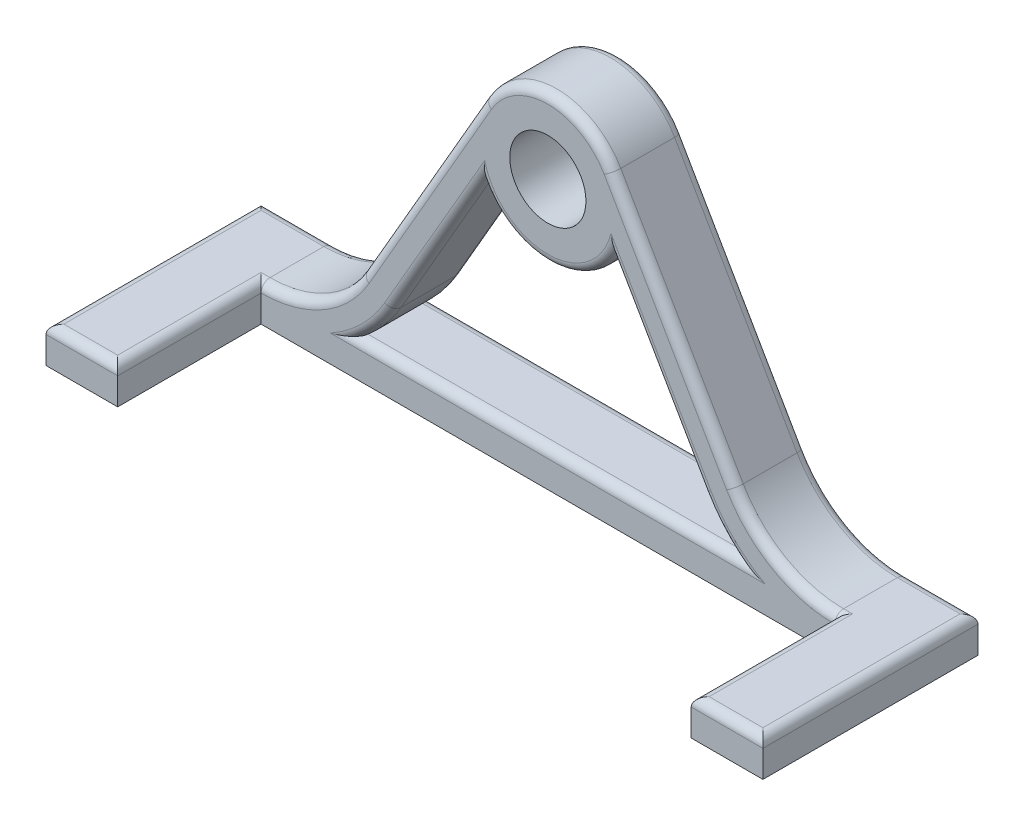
ISO-10303-21;
HEADER;
FILE_DESCRIPTION(('STEP AP214'),'2;1');
FILE_NAME('part.step','',(''),(''),'','','');
FILE_SCHEMA(('AUTOMOTIVE_DESIGN { 1 0 10303 214 1 1 1 1 }'));
ENDSEC;
DATA;
#1=APPLICATION_CONTEXT('core data for automotive mechanical design processes');
#2=APPLICATION_PROTOCOL_DEFINITION('international standard','automotive_design',2000,#1);
#3=PRODUCT_CONTEXT('',#1,'mechanical');
#4=PRODUCT('Part','Part','',(#3));
#5=PRODUCT_RELATED_PRODUCT_CATEGORY('part','',(#4));
#6=PRODUCT_DEFINITION_FORMATION('','',#4);
#7=PRODUCT_DEFINITION_CONTEXT('part definition',#1,'design');
#8=PRODUCT_DEFINITION('design','',#6,#7);
#9=PRODUCT_DEFINITION_SHAPE('','',#8);
#10=(LENGTH_UNIT() NAMED_UNIT(*) SI_UNIT(.MILLI.,.METRE.));
#11=(NAMED_UNIT(*) PLANE_ANGLE_UNIT() SI_UNIT($,.RADIAN.));
#12=(NAMED_UNIT(*) SI_UNIT($,.STERADIAN.) SOLID_ANGLE_UNIT());
#13=UNCERTAINTY_MEASURE_WITH_UNIT(LENGTH_MEASURE(1.E-05),#10,'distance_accuracy_value','');
#14=(GEOMETRIC_REPRESENTATION_CONTEXT(3) GLOBAL_UNCERTAINTY_ASSIGNED_CONTEXT((#13)) GLOBAL_UNIT_ASSIGNED_CONTEXT((#10,
#11,#12)) REPRESENTATION_CONTEXT('',''));
#15=CARTESIAN_POINT('',(0.,0.,0.));
#16=DIRECTION('',(0.,0.,1.));
#17=DIRECTION('',(1.,0.,0.));
#18=AXIS2_PLACEMENT_3D('',#15,#16,#17);
#19=CARTESIAN_POINT('',(50.8,26.8694310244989,12.7));
#20=DIRECTION('',(0.,0.,1.));
#21=DIRECTION('',(1.,0.,0.));
#22=AXIS2_PLACEMENT_3D('',#19,#20,#21);
#23=PLANE('',#22);
#24=CARTESIAN_POINT('',(50.8,26.8694310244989,12.7));
#25=DIRECTION('',(0.,0.,1.));
#26=DIRECTION('',(1.,0.,0.));
#27=AXIS2_PLACEMENT_3D('',#24,#25,#26);
#28=CIRCLE('',#27,25.2819310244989);
#29=CARTESIAN_POINT('',(28.905205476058,14.2284655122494,12.7));
#30=VERTEX_POINT('',#29);
#31=CARTESIAN_POINT('',(38.533801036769,4.7625,12.7));
#32=VERTEX_POINT('',#31);
#33=EDGE_CURVE('E439',#30,#32,#28,.T.);
#34=ORIENTED_EDGE('',*,*,#33,.T.);
#35=DIRECTION('',(1.,0.,0.));
#36=VECTOR('',#35,1.);
#37=CARTESIAN_POINT('',(-33.452975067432,4.7625,12.7));
#38=LINE('',#37,#36);
#39=CARTESIAN_POINT('',(-38.533801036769,4.7625,12.7));
#40=VERTEX_POINT('',#39);
#41=EDGE_CURVE('E442',#32,#40,#38,.F.);
#42=ORIENTED_EDGE('',*,*,#41,.T.);
#43=CARTESIAN_POINT('',(-50.8,26.8694310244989,12.7));
#44=DIRECTION('',(0.,0.,1.));
#45=DIRECTION('',(1.,0.,0.));
#46=AXIS2_PLACEMENT_3D('',#43,#44,#45);
#47=CIRCLE('',#46,25.2819310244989);
#48=CARTESIAN_POINT('',(-28.905205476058,14.2284655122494,12.7));
#49=VERTEX_POINT('',#48);
#50=EDGE_CURVE('E437',#40,#49,#47,.T.);
#51=ORIENTED_EDGE('',*,*,#50,.T.);
#52=DIRECTION('',(-0.5,-0.866025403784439,0.));
#53=VECTOR('',#52,1.);
#54=CARTESIAN_POINT('',(-12.8304405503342,42.0707750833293,12.7));
#55=LINE('',#54,#53);
#56=CARTESIAN_POINT('',(-11.1865304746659,44.918110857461,12.7));
#57=VERTEX_POINT('',#56);
#58=EDGE_CURVE('E433',#49,#57,#55,.F.);
#59=ORIENTED_EDGE('',*,*,#58,.T.);
#60=CARTESIAN_POINT('',(0.,47.625,12.7));
#61=DIRECTION('',(0.,0.,1.));
#62=DIRECTION('',(1.,0.,0.));
#63=AXIS2_PLACEMENT_3D('',#60,#61,#62);
#64=CIRCLE('',#63,11.509375);
#65=CARTESIAN_POINT('',(11.1865304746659,44.918110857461,12.7));
#66=VERTEX_POINT('',#65);
#67=EDGE_CURVE('E431',#57,#66,#64,.T.);
#68=ORIENTED_EDGE('',*,*,#67,.T.);
#69=DIRECTION('',(-0.5,0.866025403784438,0.));
#70=VECTOR('',#69,1.);
#71=CARTESIAN_POINT('',(28.905205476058,14.2284655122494,12.7));
#72=LINE('',#71,#70);
#73=EDGE_CURVE('E435',#66,#30,#72,.F.);
#74=ORIENTED_EDGE('',*,*,#73,.T.);
#75=EDGE_LOOP('',(#34,#42,#51,#59,#68,#74));
#76=FACE_BOUND('',#75,.T.);
#77=DIRECTION('',(0.,-1.,0.));
#78=VECTOR('',#77,1.);
#79=CARTESIAN_POINT('',(50.8,26.8694310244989,12.7));
#80=LINE('',#79,#78);
#81=CARTESIAN_POINT('',(50.8,4.7625,12.7));
#82=VERTEX_POINT('',#81);
#83=CARTESIAN_POINT('',(50.8,0.,12.7));
#84=VERTEX_POINT('',#83);
#85=EDGE_CURVE('E302',#82,#84,#80,.T.);
#86=ORIENTED_EDGE('',*,*,#85,.F.);
#87=CARTESIAN_POINT('',(50.8,26.8694310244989,12.7));
#88=DIRECTION('',(0.,0.,1.));
#89=DIRECTION('',(1.,0.,0.));
#90=AXIS2_PLACEMENT_3D('',#87,#88,#89);
#91=CIRCLE('',#90,22.1069310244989);
#92=CARTESIAN_POINT('',(31.6548361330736,15.8159655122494,12.7));
#93=VERTEX_POINT('',#92);
#94=EDGE_CURVE('E377',#82,#93,#91,.F.);
#95=ORIENTED_EDGE('',*,*,#94,.T.);
#96=DIRECTION('',(0.5,-0.866025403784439,0.));
#97=VECTOR('',#96,1.);
#98=CARTESIAN_POINT('',(31.6548361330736,15.8159655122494,12.7));
#99=LINE('',#98,#97);
#100=CARTESIAN_POINT('',(9.96741113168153,53.3796875,12.7));
#101=VERTEX_POINT('',#100);
#102=EDGE_CURVE('E375',#93,#101,#99,.F.);
#103=ORIENTED_EDGE('',*,*,#102,.T.);
#104=CARTESIAN_POINT('',(0.,47.625,12.7));
#105=DIRECTION('',(0.,0.,1.));
#106=DIRECTION('',(1.,0.,0.));
#107=AXIS2_PLACEMENT_3D('',#104,#105,#106);
#108=CIRCLE('',#107,11.509375);
#109=CARTESIAN_POINT('',(-9.96741113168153,53.3796875,12.7));
#110=VERTEX_POINT('',#109);
#111=EDGE_CURVE('E373',#101,#110,#108,.T.);
#112=ORIENTED_EDGE('',*,*,#111,.T.);
#113=DIRECTION('',(-0.5,-0.866025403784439,0.));
#114=VECTOR('',#113,1.);
#115=CARTESIAN_POINT('',(-31.6548361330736,15.8159655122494,12.7));
#116=LINE('',#115,#114);
#117=CARTESIAN_POINT('',(-31.6548361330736,15.8159655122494,12.7));
#118=VERTEX_POINT('',#117);
#119=EDGE_CURVE('E369',#110,#118,#116,.T.);
#120=ORIENTED_EDGE('',*,*,#119,.T.);
#121=CARTESIAN_POINT('',(-50.8,26.8694310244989,12.7));
#122=DIRECTION('',(0.,0.,1.));
#123=DIRECTION('',(1.,0.,0.));
#124=AXIS2_PLACEMENT_3D('',#121,#122,#123);
#125=CIRCLE('',#124,22.1069310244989);
#126=CARTESIAN_POINT('',(-50.8,4.7625,12.7));
#127=VERTEX_POINT('',#126);
#128=EDGE_CURVE('E371',#118,#127,#125,.F.);
#129=ORIENTED_EDGE('',*,*,#128,.T.);
#130=DIRECTION('',(0.,-1.,0.));
#131=VECTOR('',#130,1.);
#132=CARTESIAN_POINT('',(-50.8,26.8694310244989,12.7));
#133=LINE('',#132,#131);
#134=CARTESIAN_POINT('',(-50.8,0.,12.7));
#135=VERTEX_POINT('',#134);
#136=EDGE_CURVE('E265',#127,#135,#133,.T.);
#137=ORIENTED_EDGE('',*,*,#136,.T.);
#138=DIRECTION('',(1.,0.,0.));
#139=VECTOR('',#138,1.);
#140=CARTESIAN_POINT('',(-63.5,0.,12.7));
#141=LINE('',#140,#139);
#142=EDGE_CURVE('E332',#135,#84,#141,.T.);
#143=ORIENTED_EDGE('',*,*,#142,.T.);
#144=EDGE_LOOP('',(#86,#95,#103,#112,#120,#129,#137,#143));
#145=FACE_BOUND('',#144,.T.);
#146=CARTESIAN_POINT('',(0.,47.625,12.7));
#147=DIRECTION('',(0.,0.,1.));
#148=DIRECTION('',(1.,0.,0.));
#149=AXIS2_PLACEMENT_3D('',#146,#147,#148);
#150=CIRCLE('',#149,6.746875);
#151=CARTESIAN_POINT('',(6.746875,47.625,12.7));
#152=VERTEX_POINT('',#151);
#153=EDGE_CURVE('E324',#152,#152,#150,.T.);
#154=ORIENTED_EDGE('',*,*,#153,.F.);
#155=EDGE_LOOP('',(#154));
#156=FACE_BOUND('',#155,.T.);
#157=ADVANCED_FACE('F28',(#76,#145,#156),#23,.T.);
#158=CARTESIAN_POINT('',(50.8,26.8694310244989,0.));
#159=DIRECTION('',(0.,0.,1.));
#160=DIRECTION('',(1.,0.,0.));
#161=AXIS2_PLACEMENT_3D('',#158,#159,#160);
#162=PLANE('',#161);
#163=CARTESIAN_POINT('',(-50.8,26.8694310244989,0.));
#164=DIRECTION('',(0.,0.,1.));
#165=DIRECTION('',(1.,0.,0.));
#166=AXIS2_PLACEMENT_3D('',#163,#164,#165);
#167=CIRCLE('',#166,25.2819310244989);
#168=CARTESIAN_POINT('',(-28.905205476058,14.2284655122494,0.));
#169=VERTEX_POINT('',#168);
#170=CARTESIAN_POINT('',(-38.533801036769,4.7625,0.));
#171=VERTEX_POINT('',#170);
#172=EDGE_CURVE('E460',#169,#171,#167,.F.);
#173=ORIENTED_EDGE('',*,*,#172,.T.);
#174=DIRECTION('',(1.,0.,0.));
#175=VECTOR('',#174,1.);
#176=CARTESIAN_POINT('',(50.8,4.7625,0.));
#177=LINE('',#176,#175);
#178=CARTESIAN_POINT('',(38.533801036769,4.7625,0.));
#179=VERTEX_POINT('',#178);
#180=EDGE_CURVE('E465',#171,#179,#177,.T.);
#181=ORIENTED_EDGE('',*,*,#180,.T.);
#182=CARTESIAN_POINT('',(50.8,26.8694310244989,0.));
#183=DIRECTION('',(0.,0.,1.));
#184=DIRECTION('',(1.,0.,0.));
#185=AXIS2_PLACEMENT_3D('',#182,#183,#184);
#186=CIRCLE('',#185,25.2819310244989);
#187=CARTESIAN_POINT('',(28.905205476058,14.2284655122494,0.));
#188=VERTEX_POINT('',#187);
#189=EDGE_CURVE('E462',#179,#188,#186,.F.);
#190=ORIENTED_EDGE('',*,*,#189,.T.);
#191=DIRECTION('',(-0.5,0.866025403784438,0.));
#192=VECTOR('',#191,1.);
#193=CARTESIAN_POINT('',(28.905205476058,14.2284655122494,0.));
#194=LINE('',#193,#192);
#195=CARTESIAN_POINT('',(11.1865304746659,44.918110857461,0.));
#196=VERTEX_POINT('',#195);
#197=EDGE_CURVE('E458',#188,#196,#194,.T.);
#198=ORIENTED_EDGE('',*,*,#197,.T.);
#199=CARTESIAN_POINT('',(0.,47.625,0.));
#200=DIRECTION('',(0.,0.,1.));
#201=DIRECTION('',(1.,0.,0.));
#202=AXIS2_PLACEMENT_3D('',#199,#200,#201);
#203=CIRCLE('',#202,11.509375);
#204=CARTESIAN_POINT('',(-11.186530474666,44.918110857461,0.));
#205=VERTEX_POINT('',#204);
#206=EDGE_CURVE('E456',#196,#205,#203,.F.);
#207=ORIENTED_EDGE('',*,*,#206,.T.);
#208=DIRECTION('',(-0.5,-0.866025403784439,0.));
#209=VECTOR('',#208,1.);
#210=CARTESIAN_POINT('',(-3.50520547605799,58.2225560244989,0.));
#211=LINE('',#210,#209);
#212=EDGE_CURVE('E454',#205,#169,#211,.T.);
#213=ORIENTED_EDGE('',*,*,#212,.T.);
#214=EDGE_LOOP('',(#173,#181,#190,#198,#207,#213));
#215=FACE_BOUND('',#214,.T.);
#216=DIRECTION('',(0.,-1.,0.));
#217=VECTOR('',#216,1.);
#218=CARTESIAN_POINT('',(-63.5,6.35,0.));
#219=LINE('',#218,#217);
#220=CARTESIAN_POINT('',(-63.5,4.7625,0.));
#221=VERTEX_POINT('',#220);
#222=CARTESIAN_POINT('',(-63.5,0.,0.));
#223=VERTEX_POINT('',#222);
#224=EDGE_CURVE('E271',#221,#223,#219,.T.);
#225=ORIENTED_EDGE('',*,*,#224,.F.);
#226=DIRECTION('',(-1.,0.,0.));
#227=VECTOR('',#226,1.);
#228=CARTESIAN_POINT('',(50.8,4.7625,0.));
#229=LINE('',#228,#227);
#230=CARTESIAN_POINT('',(-50.8,4.76249999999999,0.));
#231=VERTEX_POINT('',#230);
#232=EDGE_CURVE('E396',#221,#231,#229,.F.);
#233=ORIENTED_EDGE('',*,*,#232,.T.);
#234=CARTESIAN_POINT('',(-50.8,26.8694310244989,0.));
#235=DIRECTION('',(0.,0.,1.));
#236=DIRECTION('',(1.,0.,0.));
#237=AXIS2_PLACEMENT_3D('',#234,#235,#236);
#238=CIRCLE('',#237,22.1069310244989);
#239=CARTESIAN_POINT('',(-31.6548361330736,15.8159655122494,0.));
#240=VERTEX_POINT('',#239);
#241=EDGE_CURVE('E394',#231,#240,#238,.T.);
#242=ORIENTED_EDGE('',*,*,#241,.T.);
#243=DIRECTION('',(-0.5,-0.866025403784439,0.));
#244=VECTOR('',#243,1.);
#245=CARTESIAN_POINT('',(-6.25483613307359,59.8100560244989,0.));
#246=LINE('',#245,#244);
#247=CARTESIAN_POINT('',(-9.96741113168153,53.3796875,0.));
#248=VERTEX_POINT('',#247);
#249=EDGE_CURVE('E392',#240,#248,#246,.F.);
#250=ORIENTED_EDGE('',*,*,#249,.T.);
#251=CARTESIAN_POINT('',(0.,47.625,0.));
#252=DIRECTION('',(0.,0.,1.));
#253=DIRECTION('',(1.,0.,0.));
#254=AXIS2_PLACEMENT_3D('',#251,#252,#253);
#255=CIRCLE('',#254,11.509375);
#256=CARTESIAN_POINT('',(9.96741113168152,53.3796875,0.));
#257=VERTEX_POINT('',#256);
#258=EDGE_CURVE('E390',#248,#257,#255,.F.);
#259=ORIENTED_EDGE('',*,*,#258,.T.);
#260=DIRECTION('',(0.5,-0.866025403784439,0.));
#261=VECTOR('',#260,1.);
#262=CARTESIAN_POINT('',(31.6548361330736,15.8159655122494,0.));
#263=LINE('',#262,#261);
#264=CARTESIAN_POINT('',(31.6548361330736,15.8159655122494,0.));
#265=VERTEX_POINT('',#264);
#266=EDGE_CURVE('E388',#257,#265,#263,.T.);
#267=ORIENTED_EDGE('',*,*,#266,.T.);
#268=CARTESIAN_POINT('',(50.8,26.8694310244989,0.));
#269=DIRECTION('',(0.,0.,1.));
#270=DIRECTION('',(1.,0.,0.));
#271=AXIS2_PLACEMENT_3D('',#268,#269,#270);
#272=CIRCLE('',#271,22.1069310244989);
#273=CARTESIAN_POINT('',(50.8,4.7625,0.));
#274=VERTEX_POINT('',#273);
#275=EDGE_CURVE('E386',#265,#274,#272,.T.);
#276=ORIENTED_EDGE('',*,*,#275,.T.);
#277=DIRECTION('',(1.,0.,0.));
#278=VECTOR('',#277,1.);
#279=CARTESIAN_POINT('',(63.5,4.7625,0.));
#280=LINE('',#279,#278);
#281=CARTESIAN_POINT('',(63.5,4.7625,0.));
#282=VERTEX_POINT('',#281);
#283=EDGE_CURVE('E384',#274,#282,#280,.T.);
#284=ORIENTED_EDGE('',*,*,#283,.T.);
#285=DIRECTION('',(0.,-1.,0.));
#286=VECTOR('',#285,1.);
#287=CARTESIAN_POINT('',(63.5,6.35,0.));
#288=LINE('',#287,#286);
#289=CARTESIAN_POINT('',(63.5,0.,0.));
#290=VERTEX_POINT('',#289);
#291=EDGE_CURVE('E330',#282,#290,#288,.T.);
#292=ORIENTED_EDGE('',*,*,#291,.T.);
#293=DIRECTION('',(1.,0.,0.));
#294=VECTOR('',#293,1.);
#295=CARTESIAN_POINT('',(-63.5,0.,0.));
#296=LINE('',#295,#294);
#297=EDGE_CURVE('E328',#223,#290,#296,.T.);
#298=ORIENTED_EDGE('',*,*,#297,.F.);
#299=EDGE_LOOP('',(#225,#233,#242,#250,#259,#267,#276,#284,#292,#298));
#300=FACE_BOUND('',#299,.T.);
#301=CARTESIAN_POINT('',(0.,47.625,0.));
#302=DIRECTION('',(0.,0.,1.));
#303=DIRECTION('',(1.,0.,0.));
#304=AXIS2_PLACEMENT_3D('',#301,#302,#303);
#305=CIRCLE('',#304,6.746875);
#306=CARTESIAN_POINT('',(6.746875,47.625,0.));
#307=VERTEX_POINT('',#306);
#308=EDGE_CURVE('E321',#307,#307,#305,.T.);
#309=ORIENTED_EDGE('',*,*,#308,.T.);
#310=EDGE_LOOP('',(#309));
#311=FACE_BOUND('',#310,.T.);
#312=ADVANCED_FACE('F711',(#215,#300,#311),#162,.F.);
#313=CARTESIAN_POINT('',(-63.5,6.35,12.7));
#314=DIRECTION('',(1.,0.,0.));
#315=DIRECTION('',(0.,1.,0.));
#316=AXIS2_PLACEMENT_3D('',#313,#314,#315);
#317=PLANE('',#316);
#318=DIRECTION('',(0.,-1.,0.));
#319=VECTOR('',#318,1.);
#320=CARTESIAN_POINT('',(-63.5,6.35,38.1));
#321=LINE('',#320,#319);
#322=CARTESIAN_POINT('',(-63.5,4.7625,38.1));
#323=VERTEX_POINT('',#322);
#324=CARTESIAN_POINT('',(-63.5,0.,38.1));
#325=VERTEX_POINT('',#324);
#326=EDGE_CURVE('E255',#323,#325,#321,.T.);
#327=ORIENTED_EDGE('',*,*,#326,.F.);
#328=DIRECTION('',(0.,0.,-1.));
#329=VECTOR('',#328,1.);
#330=CARTESIAN_POINT('',(-63.5,4.7625,12.7));
#331=LINE('',#330,#329);
#332=EDGE_CURVE('E423',#323,#221,#331,.T.);
#333=ORIENTED_EDGE('',*,*,#332,.T.);
#334=ORIENTED_EDGE('',*,*,#224,.T.);
#335=DIRECTION('',(0.,0.,-1.));
#336=VECTOR('',#335,1.);
#337=CARTESIAN_POINT('',(-63.5,0.,12.7));
#338=LINE('',#337,#336);
#339=EDGE_CURVE('E269',#325,#223,#338,.T.);
#340=ORIENTED_EDGE('',*,*,#339,.F.);
#341=EDGE_LOOP('',(#327,#333,#334,#340));
#342=FACE_BOUND('',#341,.T.);
#343=ADVANCED_FACE('F30',(#342),#317,.F.);
#344=CARTESIAN_POINT('',(-63.5,0.,12.7));
#345=DIRECTION('',(0.,1.,0.));
#346=DIRECTION('',(0.,0.,1.));
#347=AXIS2_PLACEMENT_3D('',#344,#345,#346);
#348=PLANE('',#347);
#349=ORIENTED_EDGE('',*,*,#297,.T.);
#350=DIRECTION('',(0.,0.,-1.));
#351=VECTOR('',#350,1.);
#352=CARTESIAN_POINT('',(63.5,0.,12.7));
#353=LINE('',#352,#351);
#354=CARTESIAN_POINT('',(63.5,0.,38.1));
#355=VERTEX_POINT('',#354);
#356=EDGE_CURVE('E276',#355,#290,#353,.T.);
#357=ORIENTED_EDGE('',*,*,#356,.F.);
#358=DIRECTION('',(1.,0.,0.));
#359=VECTOR('',#358,1.);
#360=CARTESIAN_POINT('',(50.8,0.,38.1));
#361=LINE('',#360,#359);
#362=CARTESIAN_POINT('',(50.8,0.,38.1));
#363=VERTEX_POINT('',#362);
#364=EDGE_CURVE('E293',#363,#355,#361,.T.);
#365=ORIENTED_EDGE('',*,*,#364,.F.);
#366=DIRECTION('',(0.,0.,-1.));
#367=VECTOR('',#366,1.);
#368=CARTESIAN_POINT('',(50.8,0.,38.1));
#369=LINE('',#368,#367);
#370=EDGE_CURVE('E296',#363,#84,#369,.T.);
#371=ORIENTED_EDGE('',*,*,#370,.T.);
#372=ORIENTED_EDGE('',*,*,#142,.F.);
#373=DIRECTION('',(0.,0.,-1.));
#374=VECTOR('',#373,1.);
#375=CARTESIAN_POINT('',(-50.8,0.,38.1));
#376=LINE('',#375,#374);
#377=CARTESIAN_POINT('',(-50.8,0.,38.1));
#378=VERTEX_POINT('',#377);
#379=EDGE_CURVE('E282',#378,#135,#376,.T.);
#380=ORIENTED_EDGE('',*,*,#379,.F.);
#381=DIRECTION('',(-1.,0.,0.));
#382=VECTOR('',#381,1.);
#383=CARTESIAN_POINT('',(-50.8,0.,38.1));
#384=LINE('',#383,#382);
#385=EDGE_CURVE('E260',#378,#325,#384,.T.);
#386=ORIENTED_EDGE('',*,*,#385,.T.);
#387=ORIENTED_EDGE('',*,*,#339,.T.);
#388=EDGE_LOOP('',(#349,#357,#365,#371,#372,#380,#386,#387));
#389=FACE_BOUND('',#388,.T.);
#390=ADVANCED_FACE('F279',(#389),#348,.F.);
#391=CARTESIAN_POINT('',(63.5,6.35,12.7));
#392=DIRECTION('',(1.,0.,0.));
#393=DIRECTION('',(0.,1.,0.));
#394=AXIS2_PLACEMENT_3D('',#391,#392,#393);
#395=PLANE('',#394);
#396=ORIENTED_EDGE('',*,*,#291,.F.);
#397=DIRECTION('',(0.,0.,-1.));
#398=VECTOR('',#397,1.);
#399=CARTESIAN_POINT('',(63.5,4.7625,12.7));
#400=LINE('',#399,#398);
#401=CARTESIAN_POINT('',(63.5,4.7625,38.1));
#402=VERTEX_POINT('',#401);
#403=EDGE_CURVE('E425',#282,#402,#400,.F.);
#404=ORIENTED_EDGE('',*,*,#403,.T.);
#405=DIRECTION('',(0.,-1.,0.));
#406=VECTOR('',#405,1.);
#407=CARTESIAN_POINT('',(63.5,6.35,38.1));
#408=LINE('',#407,#406);
#409=EDGE_CURVE('E299',#402,#355,#408,.T.);
#410=ORIENTED_EDGE('',*,*,#409,.T.);
#411=ORIENTED_EDGE('',*,*,#356,.T.);
#412=EDGE_LOOP('',(#396,#404,#410,#411));
#413=FACE_BOUND('',#412,.T.);
#414=ADVANCED_FACE('F714',(#413),#395,.T.);
#415=CARTESIAN_POINT('',(50.8,6.35,12.7));
#416=DIRECTION('',(0.,1.,0.));
#417=DIRECTION('',(0.,0.,1.));
#418=AXIS2_PLACEMENT_3D('',#415,#416,#417);
#419=PLANE('',#418);
#420=DIRECTION('',(0.,0.,-1.));
#421=VECTOR('',#420,1.);
#422=CARTESIAN_POINT('',(50.8,6.35,12.7));
#423=LINE('',#422,#421);
#424=CARTESIAN_POINT('',(50.8,6.35,11.1125));
#425=VERTEX_POINT('',#424);
#426=CARTESIAN_POINT('',(50.8,6.35,1.5875));
#427=VERTEX_POINT('',#426);
#428=EDGE_CURVE('E350',#425,#427,#423,.T.);
#429=ORIENTED_EDGE('',*,*,#428,.F.);
#430=DIRECTION('',(1.,0.,0.));
#431=VECTOR('',#430,1.);
#432=CARTESIAN_POINT('',(50.8,6.35,11.1125));
#433=LINE('',#432,#431);
#434=CARTESIAN_POINT('',(52.3875,6.35,11.1125));
#435=VERTEX_POINT('',#434);
#436=EDGE_CURVE('E367',#425,#435,#433,.T.);
#437=ORIENTED_EDGE('',*,*,#436,.T.);
#438=DIRECTION('',(0.,0.,-1.));
#439=VECTOR('',#438,1.);
#440=CARTESIAN_POINT('',(52.3875,6.35,12.7));
#441=LINE('',#440,#439);
#442=CARTESIAN_POINT('',(52.3875,6.35,36.5125));
#443=VERTEX_POINT('',#442);
#444=EDGE_CURVE('E365',#435,#443,#441,.F.);
#445=ORIENTED_EDGE('',*,*,#444,.T.);
#446=DIRECTION('',(1.,0.,0.));
#447=VECTOR('',#446,1.);
#448=CARTESIAN_POINT('',(63.5,6.35,36.5125));
#449=LINE('',#448,#447);
#450=CARTESIAN_POINT('',(61.9125,6.35,36.5125));
#451=VERTEX_POINT('',#450);
#452=EDGE_CURVE('E363',#443,#451,#449,.T.);
#453=ORIENTED_EDGE('',*,*,#452,.T.);
#454=DIRECTION('',(0.,0.,-1.));
#455=VECTOR('',#454,1.);
#456=CARTESIAN_POINT('',(61.9125,6.35,12.7));
#457=LINE('',#456,#455);
#458=CARTESIAN_POINT('',(61.9125,6.35,1.5875));
#459=VERTEX_POINT('',#458);
#460=EDGE_CURVE('E361',#451,#459,#457,.T.);
#461=ORIENTED_EDGE('',*,*,#460,.T.);
#462=DIRECTION('',(1.,0.,0.));
#463=VECTOR('',#462,1.);
#464=CARTESIAN_POINT('',(50.8,6.35,1.5875));
#465=LINE('',#464,#463);
#466=EDGE_CURVE('E359',#459,#427,#465,.F.);
#467=ORIENTED_EDGE('',*,*,#466,.T.);
#468=EDGE_LOOP('',(#429,#437,#445,#453,#461,#467));
#469=FACE_BOUND('',#468,.T.);
#470=ADVANCED_FACE('F745',(#469),#419,.T.);
#471=CARTESIAN_POINT('',(50.8,26.8694310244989,12.7));
#472=DIRECTION('',(0.,0.,-1.));
#473=DIRECTION('',(-1.,0.,0.));
#474=AXIS2_PLACEMENT_3D('',#471,#472,#473);
#475=CYLINDRICAL_SURFACE('',#474,20.5194310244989);
#476=DIRECTION('',(0.,0.,-1.));
#477=VECTOR('',#476,1.);
#478=CARTESIAN_POINT('',(33.0296514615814,16.6097155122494,12.7));
#479=LINE('',#478,#477);
#480=CARTESIAN_POINT('',(33.0296514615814,16.6097155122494,11.1125));
#481=VERTEX_POINT('',#480);
#482=CARTESIAN_POINT('',(33.0296514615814,16.6097155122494,1.5875));
#483=VERTEX_POINT('',#482);
#484=EDGE_CURVE('E347',#481,#483,#479,.T.);
#485=ORIENTED_EDGE('',*,*,#484,.F.);
#486=CARTESIAN_POINT('',(50.8,26.8694310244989,11.1125));
#487=DIRECTION('',(0.,0.,1.));
#488=DIRECTION('',(1.,0.,0.));
#489=AXIS2_PLACEMENT_3D('',#486,#487,#488);
#490=CIRCLE('',#489,20.5194310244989);
#491=EDGE_CURVE('E356',#481,#425,#490,.T.);
#492=ORIENTED_EDGE('',*,*,#491,.T.);
#493=ORIENTED_EDGE('',*,*,#428,.T.);
#494=CARTESIAN_POINT('',(50.8,26.8694310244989,1.5875));
#495=DIRECTION('',(0.,0.,1.));
#496=DIRECTION('',(1.,0.,0.));
#497=AXIS2_PLACEMENT_3D('',#494,#495,#496);
#498=CIRCLE('',#497,20.5194310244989);
#499=EDGE_CURVE('E275',#427,#483,#498,.F.);
#500=ORIENTED_EDGE('',*,*,#499,.T.);
#501=EDGE_LOOP('',(#485,#492,#493,#500));
#502=FACE_BOUND('',#501,.T.);
#503=ADVANCED_FACE('F695',(#502),#475,.F.);
#504=CARTESIAN_POINT('',(11.3422264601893,54.1734375,12.7));
#505=DIRECTION('',(0.866025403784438,0.5,0.));
#506=DIRECTION('',(-0.5,0.866025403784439,0.));
#507=AXIS2_PLACEMENT_3D('',#504,#505,#506);
#508=PLANE('',#507);
#509=DIRECTION('',(0.,0.,-1.));
#510=VECTOR('',#509,1.);
#511=CARTESIAN_POINT('',(11.3422264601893,54.1734375,12.7));
#512=LINE('',#511,#510);
#513=CARTESIAN_POINT('',(11.3422264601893,54.1734375,11.1125));
#514=VERTEX_POINT('',#513);
#515=CARTESIAN_POINT('',(11.3422264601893,54.1734375,1.5875));
#516=VERTEX_POINT('',#515);
#517=EDGE_CURVE('E344',#514,#516,#512,.T.);
#518=ORIENTED_EDGE('',*,*,#517,.F.);
#519=DIRECTION('',(0.5,-0.866025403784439,0.));
#520=VECTOR('',#519,1.);
#521=CARTESIAN_POINT('',(11.3422264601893,54.1734375,11.1125));
#522=LINE('',#521,#520);
#523=EDGE_CURVE('E382',#514,#481,#522,.T.);
#524=ORIENTED_EDGE('',*,*,#523,.T.);
#525=ORIENTED_EDGE('',*,*,#484,.T.);
#526=DIRECTION('',(0.5,-0.866025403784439,0.));
#527=VECTOR('',#526,1.);
#528=CARTESIAN_POINT('',(11.3422264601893,54.1734375,1.5875));
#529=LINE('',#528,#527);
#530=EDGE_CURVE('E380',#483,#516,#529,.F.);
#531=ORIENTED_EDGE('',*,*,#530,.T.);
#532=EDGE_LOOP('',(#518,#524,#525,#531));
#533=FACE_BOUND('',#532,.T.);
#534=ADVANCED_FACE('F692',(#533),#508,.T.);
#535=CARTESIAN_POINT('',(0.,47.625,12.7));
#536=DIRECTION('',(0.,0.,-1.));
#537=DIRECTION('',(-1.,0.,0.));
#538=AXIS2_PLACEMENT_3D('',#535,#536,#537);
#539=CYLINDRICAL_SURFACE('',#538,13.096875);
#540=DIRECTION('',(0.,0.,-1.));
#541=VECTOR('',#540,1.);
#542=CARTESIAN_POINT('',(-11.3422264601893,54.1734375,12.7));
#543=LINE('',#542,#541);
#544=CARTESIAN_POINT('',(-11.3422264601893,54.1734375,11.1125));
#545=VERTEX_POINT('',#544);
#546=CARTESIAN_POINT('',(-11.3422264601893,54.1734375,1.5875));
#547=VERTEX_POINT('',#546);
#548=EDGE_CURVE('E341',#545,#547,#543,.T.);
#549=ORIENTED_EDGE('',*,*,#548,.F.);
#550=CARTESIAN_POINT('',(0.,47.625,11.1125));
#551=DIRECTION('',(0.,0.,1.));
#552=DIRECTION('',(1.,0.,0.));
#553=AXIS2_PLACEMENT_3D('',#550,#551,#552);
#554=CIRCLE('',#553,13.096875);
#555=EDGE_CURVE('E400',#545,#514,#554,.F.);
#556=ORIENTED_EDGE('',*,*,#555,.T.);
#557=ORIENTED_EDGE('',*,*,#517,.T.);
#558=CARTESIAN_POINT('',(0.,47.625,1.5875));
#559=DIRECTION('',(0.,0.,1.));
#560=DIRECTION('',(1.,0.,0.));
#561=AXIS2_PLACEMENT_3D('',#558,#559,#560);
#562=CIRCLE('',#561,13.096875);
#563=EDGE_CURVE('E398',#516,#547,#562,.T.);
#564=ORIENTED_EDGE('',*,*,#563,.T.);
#565=EDGE_LOOP('',(#549,#556,#557,#564));
#566=FACE_BOUND('',#565,.T.);
#567=ADVANCED_FACE('F673',(#566),#539,.T.);
#568=CARTESIAN_POINT('',(-11.3422264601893,54.1734375,12.7));
#569=DIRECTION('',(0.866025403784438,-0.5,0.));
#570=DIRECTION('',(0.5,0.866025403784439,0.));
#571=AXIS2_PLACEMENT_3D('',#568,#569,#570);
#572=PLANE('',#571);
#573=DIRECTION('',(0.,0.,-1.));
#574=VECTOR('',#573,1.);
#575=CARTESIAN_POINT('',(-33.0296514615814,16.6097155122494,12.7));
#576=LINE('',#575,#574);
#577=CARTESIAN_POINT('',(-33.0296514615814,16.6097155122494,11.1125));
#578=VERTEX_POINT('',#577);
#579=CARTESIAN_POINT('',(-33.0296514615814,16.6097155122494,1.5875));
#580=VERTEX_POINT('',#579);
#581=EDGE_CURVE('E338',#578,#580,#576,.T.);
#582=ORIENTED_EDGE('',*,*,#581,.F.);
#583=DIRECTION('',(-0.5,-0.866025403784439,0.));
#584=VECTOR('',#583,1.);
#585=CARTESIAN_POINT('',(-11.3422264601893,54.1734375,11.1125));
#586=LINE('',#585,#584);
#587=EDGE_CURVE('E418',#578,#545,#586,.F.);
#588=ORIENTED_EDGE('',*,*,#587,.T.);
#589=ORIENTED_EDGE('',*,*,#548,.T.);
#590=DIRECTION('',(-0.5,-0.866025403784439,0.));
#591=VECTOR('',#590,1.);
#592=CARTESIAN_POINT('',(-11.3422264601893,54.1734375,1.5875));
#593=LINE('',#592,#591);
#594=EDGE_CURVE('E416',#547,#580,#593,.T.);
#595=ORIENTED_EDGE('',*,*,#594,.T.);
#596=EDGE_LOOP('',(#582,#588,#589,#595));
#597=FACE_BOUND('',#596,.T.);
#598=ADVANCED_FACE('F669',(#597),#572,.F.);
#599=CARTESIAN_POINT('',(-50.8,26.8694310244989,12.7));
#600=DIRECTION('',(0.,0.,-1.));
#601=DIRECTION('',(-1.,0.,0.));
#602=AXIS2_PLACEMENT_3D('',#599,#600,#601);
#603=CYLINDRICAL_SURFACE('',#602,20.5194310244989);
#604=DIRECTION('',(0.,0.,-1.));
#605=VECTOR('',#604,1.);
#606=CARTESIAN_POINT('',(-50.8,6.34999999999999,12.7));
#607=LINE('',#606,#605);
#608=CARTESIAN_POINT('',(-50.8,6.34999999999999,11.1125));
#609=VERTEX_POINT('',#608);
#610=CARTESIAN_POINT('',(-50.8,6.34999999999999,1.5875));
#611=VERTEX_POINT('',#610);
#612=EDGE_CURVE('E335',#609,#611,#607,.T.);
#613=ORIENTED_EDGE('',*,*,#612,.F.);
#614=CARTESIAN_POINT('',(-50.8,26.8694310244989,11.1125));
#615=DIRECTION('',(0.,0.,1.));
#616=DIRECTION('',(1.,0.,0.));
#617=AXIS2_PLACEMENT_3D('',#614,#615,#616);
#618=CIRCLE('',#617,20.5194310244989);
#619=EDGE_CURVE('E414',#609,#578,#618,.T.);
#620=ORIENTED_EDGE('',*,*,#619,.T.);
#621=ORIENTED_EDGE('',*,*,#581,.T.);
#622=CARTESIAN_POINT('',(-50.8,26.8694310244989,1.5875));
#623=DIRECTION('',(0.,0.,1.));
#624=DIRECTION('',(1.,0.,0.));
#625=AXIS2_PLACEMENT_3D('',#622,#623,#624);
#626=CIRCLE('',#625,20.5194310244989);
#627=EDGE_CURVE('E412',#580,#611,#626,.F.);
#628=ORIENTED_EDGE('',*,*,#627,.T.);
#629=EDGE_LOOP('',(#613,#620,#621,#628));
#630=FACE_BOUND('',#629,.T.);
#631=ADVANCED_FACE('F651',(#630),#603,.F.);
#632=CARTESIAN_POINT('',(-50.8,6.35,12.7));
#633=DIRECTION('',(0.,-1.,0.));
#634=DIRECTION('',(0.,0.,-1.));
#635=AXIS2_PLACEMENT_3D('',#632,#633,#634);
#636=PLANE('',#635);
#637=DIRECTION('',(0.,0.,-1.));
#638=VECTOR('',#637,1.);
#639=CARTESIAN_POINT('',(-52.3875,6.35,12.7));
#640=LINE('',#639,#638);
#641=CARTESIAN_POINT('',(-52.3875,6.35,36.5125));
#642=VERTEX_POINT('',#641);
#643=CARTESIAN_POINT('',(-52.3875,6.35,11.1125));
#644=VERTEX_POINT('',#643);
#645=EDGE_CURVE('E408',#642,#644,#640,.T.);
#646=ORIENTED_EDGE('',*,*,#645,.T.);
#647=DIRECTION('',(-1.,0.,0.));
#648=VECTOR('',#647,1.);
#649=CARTESIAN_POINT('',(-33.0296514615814,6.35,11.1125));
#650=LINE('',#649,#648);
#651=EDGE_CURVE('E410',#644,#609,#650,.F.);
#652=ORIENTED_EDGE('',*,*,#651,.T.);
#653=ORIENTED_EDGE('',*,*,#612,.T.);
#654=DIRECTION('',(-1.,0.,0.));
#655=VECTOR('',#654,1.);
#656=CARTESIAN_POINT('',(-50.8,6.35,1.5875));
#657=LINE('',#656,#655);
#658=CARTESIAN_POINT('',(-61.9125,6.35,1.5875));
#659=VERTEX_POINT('',#658);
#660=EDGE_CURVE('E402',#611,#659,#657,.T.);
#661=ORIENTED_EDGE('',*,*,#660,.T.);
#662=DIRECTION('',(0.,0.,-1.));
#663=VECTOR('',#662,1.);
#664=CARTESIAN_POINT('',(-61.9125,6.35,12.7));
#665=LINE('',#664,#663);
#666=CARTESIAN_POINT('',(-61.9125,6.35,36.5125));
#667=VERTEX_POINT('',#666);
#668=EDGE_CURVE('E404',#659,#667,#665,.F.);
#669=ORIENTED_EDGE('',*,*,#668,.T.);
#670=DIRECTION('',(-1.,0.,0.));
#671=VECTOR('',#670,1.);
#672=CARTESIAN_POINT('',(-50.8,6.35,36.5125));
#673=LINE('',#672,#671);
#674=EDGE_CURVE('E406',#667,#642,#673,.F.);
#675=ORIENTED_EDGE('',*,*,#674,.T.);
#676=EDGE_LOOP('',(#646,#652,#653,#661,#669,#675));
#677=FACE_BOUND('',#676,.T.);
#678=ADVANCED_FACE('F655',(#677),#636,.F.);
#679=CARTESIAN_POINT('',(0.,47.625,12.7));
#680=DIRECTION('',(0.,0.,-1.));
#681=DIRECTION('',(-1.,0.,0.));
#682=AXIS2_PLACEMENT_3D('',#679,#680,#681);
#683=CYLINDRICAL_SURFACE('',#682,6.746875);
#684=ORIENTED_EDGE('',*,*,#153,.T.);
#685=EDGE_LOOP('',(#684));
#686=FACE_BOUND('',#685,.T.);
#687=ORIENTED_EDGE('',*,*,#308,.F.);
#688=EDGE_LOOP('',(#687));
#689=FACE_BOUND('',#688,.T.);
#690=ADVANCED_FACE('F770',(#686,#689),#683,.F.);
#691=CARTESIAN_POINT('',(0.,47.625,0.));
#692=DIRECTION('',(0.,0.,1.));
#693=DIRECTION('',(1.,0.,0.));
#694=AXIS2_PLACEMENT_3D('',#691,#692,#693);
#695=CYLINDRICAL_SURFACE('',#694,13.096875);
#696=DIRECTION('',(0.,0.,1.));
#697=VECTOR('',#696,1.);
#698=CARTESIAN_POINT('',(11.4556252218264,41.2770250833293,0.));
#699=LINE('',#698,#697);
#700=CARTESIAN_POINT('',(11.4556252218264,41.2770250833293,1.5875));
#701=VERTEX_POINT('',#700);
#702=CARTESIAN_POINT('',(11.4556252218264,41.2770250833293,11.1125));
#703=VERTEX_POINT('',#702);
#704=EDGE_CURVE('E319',#701,#703,#699,.T.);
#705=ORIENTED_EDGE('',*,*,#704,.T.);
#706=CARTESIAN_POINT('',(0.,47.625,11.1125));
#707=DIRECTION('',(0.,0.,1.));
#708=DIRECTION('',(1.,0.,0.));
#709=AXIS2_PLACEMENT_3D('',#706,#707,#708);
#710=CIRCLE('',#709,13.096875);
#711=CARTESIAN_POINT('',(-11.4556252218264,41.2770250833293,11.1125));
#712=VERTEX_POINT('',#711);
#713=EDGE_CURVE('E11',#703,#712,#710,.F.);
#714=ORIENTED_EDGE('',*,*,#713,.T.);
#715=DIRECTION('',(0.,0.,1.));
#716=VECTOR('',#715,1.);
#717=CARTESIAN_POINT('',(-11.4556252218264,41.2770250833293,0.));
#718=LINE('',#717,#716);
#719=CARTESIAN_POINT('',(-11.4556252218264,41.2770250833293,1.5875));
#720=VERTEX_POINT('',#719);
#721=EDGE_CURVE('E305',#720,#712,#718,.T.);
#722=ORIENTED_EDGE('',*,*,#721,.F.);
#723=CARTESIAN_POINT('',(0.,47.625,1.5875));
#724=DIRECTION('',(0.,0.,1.));
#725=DIRECTION('',(1.,0.,0.));
#726=AXIS2_PLACEMENT_3D('',#723,#724,#725);
#727=CIRCLE('',#726,13.096875);
#728=EDGE_CURVE('E36',#720,#701,#727,.T.);
#729=ORIENTED_EDGE('',*,*,#728,.T.);
#730=EDGE_LOOP('',(#705,#714,#722,#729));
#731=FACE_BOUND('',#730,.T.);
#732=ADVANCED_FACE('F479',(#731),#695,.T.);
#733=CARTESIAN_POINT('',(27.5303901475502,13.4347155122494,0.));
#734=DIRECTION('',(0.866025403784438,0.5,0.));
#735=DIRECTION('',(-0.5,0.866025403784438,0.));
#736=AXIS2_PLACEMENT_3D('',#733,#734,#735);
#737=PLANE('',#736);
#738=DIRECTION('',(0.,0.,1.));
#739=VECTOR('',#738,1.);
#740=CARTESIAN_POINT('',(27.5303901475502,13.4347155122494,0.));
#741=LINE('',#740,#739);
#742=CARTESIAN_POINT('',(27.5303901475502,13.4347155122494,1.5875));
#743=VERTEX_POINT('',#742);
#744=CARTESIAN_POINT('',(27.5303901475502,13.4347155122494,11.1125));
#745=VERTEX_POINT('',#744);
#746=EDGE_CURVE('E316',#743,#745,#741,.T.);
#747=ORIENTED_EDGE('',*,*,#746,.T.);
#748=DIRECTION('',(-0.5,0.866025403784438,0.));
#749=VECTOR('',#748,1.);
#750=CARTESIAN_POINT('',(11.4556252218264,41.2770250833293,11.1125));
#751=LINE('',#750,#749);
#752=EDGE_CURVE('E469',#745,#703,#751,.T.);
#753=ORIENTED_EDGE('',*,*,#752,.T.);
#754=ORIENTED_EDGE('',*,*,#704,.F.);
#755=DIRECTION('',(-0.5,0.866025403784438,0.));
#756=VECTOR('',#755,1.);
#757=CARTESIAN_POINT('',(27.5303901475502,13.4347155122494,1.5875));
#758=LINE('',#757,#756);
#759=EDGE_CURVE('E467',#701,#743,#758,.F.);
#760=ORIENTED_EDGE('',*,*,#759,.T.);
#761=EDGE_LOOP('',(#747,#753,#754,#760));
#762=FACE_BOUND('',#761,.T.);
#763=ADVANCED_FACE('F485',(#762),#737,.F.);
#764=CARTESIAN_POINT('',(50.8,26.8694310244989,0.));
#765=DIRECTION('',(0.,0.,1.));
#766=DIRECTION('',(1.,0.,0.));
#767=AXIS2_PLACEMENT_3D('',#764,#765,#766);
#768=CYLINDRICAL_SURFACE('',#767,26.8694310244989);
#769=DIRECTION('',(0.,0.,1.));
#770=VECTOR('',#769,1.);
#771=CARTESIAN_POINT('',(33.452975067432,6.35000000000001,0.));
#772=LINE('',#771,#770);
#773=CARTESIAN_POINT('',(33.452975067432,6.35000000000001,1.5875));
#774=VERTEX_POINT('',#773);
#775=CARTESIAN_POINT('',(33.452975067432,6.35000000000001,11.1125));
#776=VERTEX_POINT('',#775);
#777=EDGE_CURVE('E313',#774,#776,#772,.T.);
#778=ORIENTED_EDGE('',*,*,#777,.T.);
#779=CARTESIAN_POINT('',(50.8,26.8694310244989,11.1125));
#780=DIRECTION('',(0.,0.,1.));
#781=DIRECTION('',(1.,0.,0.));
#782=AXIS2_PLACEMENT_3D('',#779,#780,#781);
#783=CIRCLE('',#782,26.8694310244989);
#784=EDGE_CURVE('E447',#776,#745,#783,.F.);
#785=ORIENTED_EDGE('',*,*,#784,.T.);
#786=ORIENTED_EDGE('',*,*,#746,.F.);
#787=CARTESIAN_POINT('',(50.8,26.8694310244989,1.5875));
#788=DIRECTION('',(0.,0.,1.));
#789=DIRECTION('',(1.,0.,0.));
#790=AXIS2_PLACEMENT_3D('',#787,#788,#789);
#791=CIRCLE('',#790,26.8694310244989);
#792=EDGE_CURVE('E444',#743,#774,#791,.T.);
#793=ORIENTED_EDGE('',*,*,#792,.T.);
#794=EDGE_LOOP('',(#778,#785,#786,#793));
#795=FACE_BOUND('',#794,.T.);
#796=ADVANCED_FACE('F511',(#795),#768,.T.);
#797=CARTESIAN_POINT('',(-33.452975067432,6.35,0.));
#798=DIRECTION('',(0.,-1.,0.));
#799=DIRECTION('',(0.,0.,-1.));
#800=AXIS2_PLACEMENT_3D('',#797,#798,#799);
#801=PLANE('',#800);
#802=DIRECTION('',(0.,0.,1.));
#803=VECTOR('',#802,1.);
#804=CARTESIAN_POINT('',(-33.452975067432,6.35,0.));
#805=LINE('',#804,#803);
#806=CARTESIAN_POINT('',(-33.452975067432,6.35,1.5875));
#807=VERTEX_POINT('',#806);
#808=CARTESIAN_POINT('',(-33.452975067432,6.35,11.1125));
#809=VERTEX_POINT('',#808);
#810=EDGE_CURVE('E310',#807,#809,#805,.T.);
#811=ORIENTED_EDGE('',*,*,#810,.T.);
#812=DIRECTION('',(1.,0.,0.));
#813=VECTOR('',#812,1.);
#814=CARTESIAN_POINT('',(33.452975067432,6.35,11.1125));
#815=LINE('',#814,#813);
#816=EDGE_CURVE('E473',#809,#776,#815,.T.);
#817=ORIENTED_EDGE('',*,*,#816,.T.);
#818=ORIENTED_EDGE('',*,*,#777,.F.);
#819=DIRECTION('',(1.,0.,0.));
#820=VECTOR('',#819,1.);
#821=CARTESIAN_POINT('',(-33.452975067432,6.35,1.5875));
#822=LINE('',#821,#820);
#823=EDGE_CURVE('E471',#774,#807,#822,.F.);
#824=ORIENTED_EDGE('',*,*,#823,.T.);
#825=EDGE_LOOP('',(#811,#817,#818,#824));
#826=FACE_BOUND('',#825,.T.);
#827=ADVANCED_FACE('F514',(#826),#801,.F.);
#828=CARTESIAN_POINT('',(-50.8,26.8694310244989,0.));
#829=DIRECTION('',(0.,0.,1.));
#830=DIRECTION('',(1.,0.,0.));
#831=AXIS2_PLACEMENT_3D('',#828,#829,#830);
#832=CYLINDRICAL_SURFACE('',#831,26.8694310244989);
#833=DIRECTION('',(0.,0.,1.));
#834=VECTOR('',#833,1.);
#835=CARTESIAN_POINT('',(-27.5303901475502,13.4347155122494,0.));
#836=LINE('',#835,#834);
#837=CARTESIAN_POINT('',(-27.5303901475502,13.4347155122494,1.5875));
#838=VERTEX_POINT('',#837);
#839=CARTESIAN_POINT('',(-27.5303901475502,13.4347155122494,11.1125));
#840=VERTEX_POINT('',#839);
#841=EDGE_CURVE('E307',#838,#840,#836,.T.);
#842=ORIENTED_EDGE('',*,*,#841,.T.);
#843=CARTESIAN_POINT('',(-50.8,26.8694310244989,11.1125));
#844=DIRECTION('',(0.,0.,1.));
#845=DIRECTION('',(1.,0.,0.));
#846=AXIS2_PLACEMENT_3D('',#843,#844,#845);
#847=CIRCLE('',#846,26.8694310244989);
#848=EDGE_CURVE('E452',#840,#809,#847,.F.);
#849=ORIENTED_EDGE('',*,*,#848,.T.);
#850=ORIENTED_EDGE('',*,*,#810,.F.);
#851=CARTESIAN_POINT('',(-50.8,26.8694310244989,1.5875));
#852=DIRECTION('',(0.,0.,1.));
#853=DIRECTION('',(1.,0.,0.));
#854=AXIS2_PLACEMENT_3D('',#851,#852,#853);
#855=CIRCLE('',#854,26.8694310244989);
#856=EDGE_CURVE('E450',#807,#838,#855,.T.);
#857=ORIENTED_EDGE('',*,*,#856,.T.);
#858=EDGE_LOOP('',(#842,#849,#850,#857));
#859=FACE_BOUND('',#858,.T.);
#860=ADVANCED_FACE('F1075',(#859),#832,.T.);
#861=CARTESIAN_POINT('',(-11.4556252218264,41.2770250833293,0.));
#862=DIRECTION('',(-0.866025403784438,0.5,0.));
#863=DIRECTION('',(-0.5,-0.866025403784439,0.));
#864=AXIS2_PLACEMENT_3D('',#861,#862,#863);
#865=PLANE('',#864);
#866=ORIENTED_EDGE('',*,*,#721,.T.);
#867=DIRECTION('',(-0.5,-0.866025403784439,0.));
#868=VECTOR('',#867,1.);
#869=CARTESIAN_POINT('',(-27.5303901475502,13.4347155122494,11.1125));
#870=LINE('',#869,#868);
#871=EDGE_CURVE('E476',#712,#840,#870,.T.);
#872=ORIENTED_EDGE('',*,*,#871,.T.);
#873=ORIENTED_EDGE('',*,*,#841,.F.);
#874=DIRECTION('',(-0.5,-0.866025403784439,0.));
#875=VECTOR('',#874,1.);
#876=CARTESIAN_POINT('',(-11.4556252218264,41.2770250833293,1.5875));
#877=LINE('',#876,#875);
#878=EDGE_CURVE('E48',#838,#720,#877,.F.);
#879=ORIENTED_EDGE('',*,*,#878,.T.);
#880=EDGE_LOOP('',(#866,#872,#873,#879));
#881=FACE_BOUND('',#880,.T.);
#882=ADVANCED_FACE('F834',(#881),#865,.F.);
#883=CARTESIAN_POINT('',(50.8,6.35,38.1));
#884=DIRECTION('',(-1.,0.,0.));
#885=DIRECTION('',(0.,0.,1.));
#886=AXIS2_PLACEMENT_3D('',#883,#884,#885);
#887=PLANE('',#886);
#888=DIRECTION('',(0.,-1.,0.));
#889=VECTOR('',#888,1.);
#890=CARTESIAN_POINT('',(50.8,6.35,38.1));
#891=LINE('',#890,#889);
#892=CARTESIAN_POINT('',(50.8,4.7625,38.1));
#893=VERTEX_POINT('',#892);
#894=EDGE_CURVE('E300',#893,#363,#891,.T.);
#895=ORIENTED_EDGE('',*,*,#894,.F.);
#896=DIRECTION('',(0.,0.,-1.));
#897=VECTOR('',#896,1.);
#898=CARTESIAN_POINT('',(50.8,4.7625,38.1));
#899=LINE('',#898,#897);
#900=EDGE_CURVE('E429',#893,#82,#899,.T.);
#901=ORIENTED_EDGE('',*,*,#900,.T.);
#902=ORIENTED_EDGE('',*,*,#85,.T.);
#903=ORIENTED_EDGE('',*,*,#370,.F.);
#904=EDGE_LOOP('',(#895,#901,#902,#903));
#905=FACE_BOUND('',#904,.T.);
#906=ADVANCED_FACE('F726',(#905),#887,.T.);
#907=CARTESIAN_POINT('',(50.8,6.35,38.1));
#908=DIRECTION('',(0.,0.,-1.));
#909=DIRECTION('',(-1.,0.,0.));
#910=AXIS2_PLACEMENT_3D('',#907,#908,#909);
#911=PLANE('',#910);
#912=ORIENTED_EDGE('',*,*,#409,.F.);
#913=DIRECTION('',(1.,0.,0.));
#914=VECTOR('',#913,1.);
#915=CARTESIAN_POINT('',(50.8,4.7625,38.1));
#916=LINE('',#915,#914);
#917=EDGE_CURVE('E427',#402,#893,#916,.F.);
#918=ORIENTED_EDGE('',*,*,#917,.T.);
#919=ORIENTED_EDGE('',*,*,#894,.T.);
#920=ORIENTED_EDGE('',*,*,#364,.T.);
#921=EDGE_LOOP('',(#912,#918,#919,#920));
#922=FACE_BOUND('',#921,.T.);
#923=ADVANCED_FACE('F720',(#922),#911,.F.);
#924=CARTESIAN_POINT('',(-50.8,6.35,38.1));
#925=DIRECTION('',(0.,0.,1.));
#926=DIRECTION('',(1.,0.,0.));
#927=AXIS2_PLACEMENT_3D('',#924,#925,#926);
#928=PLANE('',#927);
#929=DIRECTION('',(0.,-1.,0.));
#930=VECTOR('',#929,1.);
#931=CARTESIAN_POINT('',(-50.8,6.35,38.1));
#932=LINE('',#931,#930);
#933=CARTESIAN_POINT('',(-50.8,4.7625,38.1));
#934=VERTEX_POINT('',#933);
#935=EDGE_CURVE('E266',#934,#378,#932,.T.);
#936=ORIENTED_EDGE('',*,*,#935,.F.);
#937=DIRECTION('',(-1.,0.,0.));
#938=VECTOR('',#937,1.);
#939=CARTESIAN_POINT('',(-63.5,4.7625,38.1));
#940=LINE('',#939,#938);
#941=EDGE_CURVE('E262',#934,#323,#940,.T.);
#942=ORIENTED_EDGE('',*,*,#941,.T.);
#943=ORIENTED_EDGE('',*,*,#326,.T.);
#944=ORIENTED_EDGE('',*,*,#385,.F.);
#945=EDGE_LOOP('',(#936,#942,#943,#944));
#946=FACE_BOUND('',#945,.T.);
#947=ADVANCED_FACE('F258',(#946),#928,.T.);
#948=CARTESIAN_POINT('',(-50.8,6.35,38.1));
#949=DIRECTION('',(-1.,0.,0.));
#950=DIRECTION('',(0.,0.,1.));
#951=AXIS2_PLACEMENT_3D('',#948,#949,#950);
#952=PLANE('',#951);
#953=ORIENTED_EDGE('',*,*,#136,.F.);
#954=DIRECTION('',(0.,0.,-1.));
#955=VECTOR('',#954,1.);
#956=CARTESIAN_POINT('',(-50.8,4.7625,38.1));
#957=LINE('',#956,#955);
#958=EDGE_CURVE('E420',#127,#934,#957,.F.);
#959=ORIENTED_EDGE('',*,*,#958,.T.);
#960=ORIENTED_EDGE('',*,*,#935,.T.);
#961=ORIENTED_EDGE('',*,*,#379,.T.);
#962=EDGE_LOOP('',(#953,#959,#960,#961));
#963=FACE_BOUND('',#962,.T.);
#964=ADVANCED_FACE('F847',(#963),#952,.F.);
#965=CARTESIAN_POINT('',(-50.8,26.8694310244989,1.5875));
#966=DIRECTION('',(0.,0.,1.));
#967=DIRECTION('',(1.,0.,0.));
#968=AXIS2_PLACEMENT_3D('',#965,#966,#967);
#969=TOROIDAL_SURFACE('',#968,22.1069310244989,1.5875);
#970=CARTESIAN_POINT('',(-31.6548361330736,15.8159655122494,1.5875));
#971=DIRECTION('',(0.499999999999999,0.866025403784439,0.));
#972=DIRECTION('',(-0.866025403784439,0.499999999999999,0.));
#973=AXIS2_PLACEMENT_3D('',#970,#971,#972);
#974=CIRCLE('',#973,1.5875);
#975=EDGE_CURVE('E287',#240,#580,#974,.T.);
#976=ORIENTED_EDGE('',*,*,#975,.F.);
#977=ORIENTED_EDGE('',*,*,#241,.F.);
#978=CARTESIAN_POINT('',(-50.8,4.76249999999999,1.5875));
#979=DIRECTION('',(-1.,0.,0.));
#980=DIRECTION('',(0.,0.,1.));
#981=AXIS2_PLACEMENT_3D('',#978,#979,#980);
#982=CIRCLE('',#981,1.5875);
#983=EDGE_CURVE('E283',#611,#231,#982,.T.);
#984=ORIENTED_EDGE('',*,*,#983,.F.);
#985=ORIENTED_EDGE('',*,*,#627,.F.);
#986=EDGE_LOOP('',(#976,#977,#984,#985));
#987=FACE_BOUND('',#986,.T.);
#988=ADVANCED_FACE('F646',(#987),#969,.T.);
#989=CARTESIAN_POINT('',(-50.8,4.7625,1.5875));
#990=DIRECTION('',(-1.,0.,0.));
#991=DIRECTION('',(0.,0.,1.));
#992=AXIS2_PLACEMENT_3D('',#989,#990,#991);
#993=CYLINDRICAL_SURFACE('',#992,1.5875);
#994=ORIENTED_EDGE('',*,*,#983,.T.);
#995=ORIENTED_EDGE('',*,*,#232,.F.);
#996=CARTESIAN_POINT('',(-61.9125,4.7625,1.5875));
#997=DIRECTION('',(-0.707106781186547,0.,0.707106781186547));
#998=DIRECTION('',(-0.707106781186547,0.,-0.707106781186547));
#999=AXIS2_PLACEMENT_3D('',#996,#997,#998);
#1000=ELLIPSE('',#999,2.24506403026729,1.5875);
#1001=EDGE_CURVE('E634',#659,#221,#1000,.T.);
#1002=ORIENTED_EDGE('',*,*,#1001,.F.);
#1003=ORIENTED_EDGE('',*,*,#660,.F.);
#1004=EDGE_LOOP('',(#994,#995,#1002,#1003));
#1005=FACE_BOUND('',#1004,.T.);
#1006=ADVANCED_FACE('F861',(#1005),#993,.T.);
#1007=CARTESIAN_POINT('',(-9.96741113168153,53.3796875,1.5875));
#1008=DIRECTION('',(-0.5,-0.866025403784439,0.));
#1009=DIRECTION('',(0.866025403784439,-0.5,0.));
#1010=AXIS2_PLACEMENT_3D('',#1007,#1008,#1009);
#1011=CYLINDRICAL_SURFACE('',#1010,1.5875);
#1012=ORIENTED_EDGE('',*,*,#975,.T.);
#1013=ORIENTED_EDGE('',*,*,#594,.F.);
#1014=CARTESIAN_POINT('',(-9.96741113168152,53.3796875,1.5875));
#1015=DIRECTION('',(0.500000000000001,0.866025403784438,0.));
#1016=DIRECTION('',(-0.866025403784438,0.500000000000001,0.));
#1017=AXIS2_PLACEMENT_3D('',#1014,#1015,#1016);
#1018=CIRCLE('',#1017,1.5875);
#1019=EDGE_CURVE('E631',#248,#547,#1018,.T.);
#1020=ORIENTED_EDGE('',*,*,#1019,.F.);
#1021=ORIENTED_EDGE('',*,*,#249,.F.);
#1022=EDGE_LOOP('',(#1012,#1013,#1020,#1021));
#1023=FACE_BOUND('',#1022,.T.);
#1024=ADVANCED_FACE('F641',(#1023),#1011,.T.);
#1025=CARTESIAN_POINT('',(-61.9125,4.7625,12.7));
#1026=DIRECTION('',(0.,0.,-1.));
#1027=DIRECTION('',(-1.,0.,0.));
#1028=AXIS2_PLACEMENT_3D('',#1025,#1026,#1027);
#1029=CYLINDRICAL_SURFACE('',#1028,1.5875);
#1030=ORIENTED_EDGE('',*,*,#1001,.T.);
#1031=ORIENTED_EDGE('',*,*,#332,.F.);
#1032=CARTESIAN_POINT('',(-61.9125,4.7625,36.5125));
#1033=DIRECTION('',(-0.707106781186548,0.,-0.707106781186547));
#1034=DIRECTION('',(0.707106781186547,0.,-0.707106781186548));
#1035=AXIS2_PLACEMENT_3D('',#1032,#1033,#1034);
#1036=ELLIPSE('',#1035,2.24506403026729,1.5875);
#1037=EDGE_CURVE('E628',#667,#323,#1036,.F.);
#1038=ORIENTED_EDGE('',*,*,#1037,.F.);
#1039=ORIENTED_EDGE('',*,*,#668,.F.);
#1040=EDGE_LOOP('',(#1030,#1031,#1038,#1039));
#1041=FACE_BOUND('',#1040,.T.);
#1042=ADVANCED_FACE('F875',(#1041),#1029,.T.);
#1043=CARTESIAN_POINT('',(0.,47.625,1.5875));
#1044=DIRECTION('',(0.,0.,1.));
#1045=DIRECTION('',(1.,0.,0.));
#1046=AXIS2_PLACEMENT_3D('',#1043,#1044,#1045);
#1047=TOROIDAL_SURFACE('',#1046,11.509375,1.5875);
#1048=ORIENTED_EDGE('',*,*,#1019,.T.);
#1049=ORIENTED_EDGE('',*,*,#563,.F.);
#1050=CARTESIAN_POINT('',(9.96741113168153,53.3796875,1.5875));
#1051=DIRECTION('',(0.500000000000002,-0.866025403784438,0.));
#1052=DIRECTION('',(0.866025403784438,0.500000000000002,0.));
#1053=AXIS2_PLACEMENT_3D('',#1050,#1051,#1052);
#1054=CIRCLE('',#1053,1.5875);
#1055=EDGE_CURVE('E625',#257,#516,#1054,.T.);
#1056=ORIENTED_EDGE('',*,*,#1055,.F.);
#1057=ORIENTED_EDGE('',*,*,#258,.F.);
#1058=EDGE_LOOP('',(#1048,#1049,#1056,#1057));
#1059=FACE_BOUND('',#1058,.T.);
#1060=ADVANCED_FACE('F882',(#1059),#1047,.T.);
#1061=CARTESIAN_POINT('',(-50.8,4.7625,36.5125));
#1062=DIRECTION('',(1.,0.,0.));
#1063=DIRECTION('',(0.,0.,-1.));
#1064=AXIS2_PLACEMENT_3D('',#1061,#1062,#1063);
#1065=CYLINDRICAL_SURFACE('',#1064,1.5875);
#1066=ORIENTED_EDGE('',*,*,#1037,.T.);
#1067=ORIENTED_EDGE('',*,*,#941,.F.);
#1068=CARTESIAN_POINT('',(-52.3875,4.7625,36.5125));
#1069=DIRECTION('',(0.707106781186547,0.,-0.707106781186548));
#1070=DIRECTION('',(0.707106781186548,0.,0.707106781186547));
#1071=AXIS2_PLACEMENT_3D('',#1068,#1069,#1070);
#1072=ELLIPSE('',#1071,2.24506403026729,1.5875);
#1073=EDGE_CURVE('E622',#642,#934,#1072,.T.);
#1074=ORIENTED_EDGE('',*,*,#1073,.F.);
#1075=ORIENTED_EDGE('',*,*,#674,.F.);
#1076=EDGE_LOOP('',(#1066,#1067,#1074,#1075));
#1077=FACE_BOUND('',#1076,.T.);
#1078=ADVANCED_FACE('F890',(#1077),#1065,.T.);
#1079=CARTESIAN_POINT('',(31.6548361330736,15.8159655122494,1.5875));
#1080=DIRECTION('',(-0.5,0.866025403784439,0.));
#1081=DIRECTION('',(-0.866025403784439,-0.5,0.));
#1082=AXIS2_PLACEMENT_3D('',#1079,#1080,#1081);
#1083=CYLINDRICAL_SURFACE('',#1082,1.5875);
#1084=ORIENTED_EDGE('',*,*,#1055,.T.);
#1085=ORIENTED_EDGE('',*,*,#530,.F.);
#1086=CARTESIAN_POINT('',(31.6548361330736,15.8159655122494,1.5875));
#1087=DIRECTION('',(0.499999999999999,-0.866025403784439,0.));
#1088=DIRECTION('',(0.866025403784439,0.499999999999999,0.));
#1089=AXIS2_PLACEMENT_3D('',#1086,#1087,#1088);
#1090=CIRCLE('',#1089,1.5875);
#1091=EDGE_CURVE('E619',#265,#483,#1090,.T.);
#1092=ORIENTED_EDGE('',*,*,#1091,.F.);
#1093=ORIENTED_EDGE('',*,*,#266,.F.);
#1094=EDGE_LOOP('',(#1084,#1085,#1092,#1093));
#1095=FACE_BOUND('',#1094,.T.);
#1096=ADVANCED_FACE('F898',(#1095),#1083,.T.);
#1097=CARTESIAN_POINT('',(-52.3875,4.7625,12.7));
#1098=DIRECTION('',(0.,0.,-1.));
#1099=DIRECTION('',(-1.,0.,0.));
#1100=AXIS2_PLACEMENT_3D('',#1097,#1098,#1099);
#1101=CYLINDRICAL_SURFACE('',#1100,1.5875);
#1102=ORIENTED_EDGE('',*,*,#1073,.T.);
#1103=ORIENTED_EDGE('',*,*,#958,.F.);
#1104=CARTESIAN_POINT('',(-52.3875,4.7625,11.1125));
#1105=DIRECTION('',(0.707106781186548,0.,-0.707106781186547));
#1106=DIRECTION('',(0.707106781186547,0.,0.707106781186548));
#1107=AXIS2_PLACEMENT_3D('',#1104,#1105,#1106);
#1108=ELLIPSE('',#1107,2.24506403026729,1.5875);
#1109=EDGE_CURVE('E616',#644,#127,#1108,.T.);
#1110=ORIENTED_EDGE('',*,*,#1109,.F.);
#1111=ORIENTED_EDGE('',*,*,#645,.F.);
#1112=EDGE_LOOP('',(#1102,#1103,#1110,#1111));
#1113=FACE_BOUND('',#1112,.T.);
#1114=ADVANCED_FACE('F906',(#1113),#1101,.T.);
#1115=CARTESIAN_POINT('',(50.8,26.8694310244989,1.5875));
#1116=DIRECTION('',(0.,0.,1.));
#1117=DIRECTION('',(1.,0.,0.));
#1118=AXIS2_PLACEMENT_3D('',#1115,#1116,#1117);
#1119=TOROIDAL_SURFACE('',#1118,22.1069310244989,1.5875);
#1120=ORIENTED_EDGE('',*,*,#1091,.T.);
#1121=ORIENTED_EDGE('',*,*,#499,.F.);
#1122=CARTESIAN_POINT('',(50.8,4.7625,1.5875));
#1123=DIRECTION('',(1.,0.,0.));
#1124=DIRECTION('',(0.,0.,-1.));
#1125=AXIS2_PLACEMENT_3D('',#1122,#1123,#1124);
#1126=CIRCLE('',#1125,1.5875);
#1127=EDGE_CURVE('E613',#274,#427,#1126,.T.);
#1128=ORIENTED_EDGE('',*,*,#1127,.F.);
#1129=ORIENTED_EDGE('',*,*,#275,.F.);
#1130=EDGE_LOOP('',(#1120,#1121,#1128,#1129));
#1131=FACE_BOUND('',#1130,.T.);
#1132=ADVANCED_FACE('F700',(#1131),#1119,.T.);
#1133=CARTESIAN_POINT('',(50.8,4.7625,11.1125));
#1134=DIRECTION('',(1.,0.,0.));
#1135=DIRECTION('',(0.,0.,-1.));
#1136=AXIS2_PLACEMENT_3D('',#1133,#1134,#1135);
#1137=CYLINDRICAL_SURFACE('',#1136,1.5875);
#1138=ORIENTED_EDGE('',*,*,#651,.F.);
#1139=ORIENTED_EDGE('',*,*,#1109,.T.);
#1140=CARTESIAN_POINT('',(-50.8,4.76249999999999,11.1125));
#1141=DIRECTION('',(1.,0.,0.));
#1142=DIRECTION('',(0.,0.,-1.));
#1143=AXIS2_PLACEMENT_3D('',#1140,#1141,#1142);
#1144=CIRCLE('',#1143,1.5875);
#1145=EDGE_CURVE('E610',#609,#127,#1144,.T.);
#1146=ORIENTED_EDGE('',*,*,#1145,.F.);
#1147=EDGE_LOOP('',(#1138,#1139,#1146));
#1148=FACE_BOUND('',#1147,.T.);
#1149=ADVANCED_FACE('F661',(#1148),#1137,.T.);
#1150=CARTESIAN_POINT('',(50.8,4.7625,1.5875));
#1151=DIRECTION('',(-1.,0.,0.));
#1152=DIRECTION('',(0.,0.,1.));
#1153=AXIS2_PLACEMENT_3D('',#1150,#1151,#1152);
#1154=CYLINDRICAL_SURFACE('',#1153,1.5875);
#1155=ORIENTED_EDGE('',*,*,#1127,.T.);
#1156=ORIENTED_EDGE('',*,*,#466,.F.);
#1157=CARTESIAN_POINT('',(61.9125,4.7625,1.5875));
#1158=DIRECTION('',(-0.707106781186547,0.,-0.707106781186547));
#1159=DIRECTION('',(-0.707106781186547,0.,0.707106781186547));
#1160=AXIS2_PLACEMENT_3D('',#1157,#1158,#1159);
#1161=ELLIPSE('',#1160,2.24506403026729,1.5875);
#1162=EDGE_CURVE('E607',#282,#459,#1161,.F.);
#1163=ORIENTED_EDGE('',*,*,#1162,.F.);
#1164=ORIENTED_EDGE('',*,*,#283,.F.);
#1165=EDGE_LOOP('',(#1155,#1156,#1163,#1164));
#1166=FACE_BOUND('',#1165,.T.);
#1167=ADVANCED_FACE('F706',(#1166),#1154,.T.);
#1168=CARTESIAN_POINT('',(-50.8,26.8694310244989,11.1125));
#1169=DIRECTION('',(0.,0.,1.));
#1170=DIRECTION('',(1.,0.,0.));
#1171=AXIS2_PLACEMENT_3D('',#1168,#1169,#1170);
#1172=TOROIDAL_SURFACE('',#1171,22.1069310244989,1.5875);
#1173=ORIENTED_EDGE('',*,*,#1145,.T.);
#1174=ORIENTED_EDGE('',*,*,#128,.F.);
#1175=CARTESIAN_POINT('',(-31.6548361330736,15.8159655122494,11.1125));
#1176=DIRECTION('',(0.499999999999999,0.866025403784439,0.));
#1177=DIRECTION('',(-0.866025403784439,0.499999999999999,0.));
#1178=AXIS2_PLACEMENT_3D('',#1175,#1176,#1177);
#1179=CIRCLE('',#1178,1.5875);
#1180=EDGE_CURVE('E604',#578,#118,#1179,.T.);
#1181=ORIENTED_EDGE('',*,*,#1180,.F.);
#1182=ORIENTED_EDGE('',*,*,#619,.F.);
#1183=EDGE_LOOP('',(#1173,#1174,#1181,#1182));
#1184=FACE_BOUND('',#1183,.T.);
#1185=ADVANCED_FACE('F666',(#1184),#1172,.T.);
#1186=CARTESIAN_POINT('',(61.9125,4.7625,12.7));
#1187=DIRECTION('',(0.,0.,-1.));
#1188=DIRECTION('',(-1.,0.,0.));
#1189=AXIS2_PLACEMENT_3D('',#1186,#1187,#1188);
#1190=CYLINDRICAL_SURFACE('',#1189,1.5875);
#1191=ORIENTED_EDGE('',*,*,#1162,.T.);
#1192=ORIENTED_EDGE('',*,*,#460,.F.);
#1193=CARTESIAN_POINT('',(61.9125,4.7625,36.5125));
#1194=DIRECTION('',(-0.707106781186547,0.,0.707106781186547));
#1195=DIRECTION('',(-0.707106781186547,0.,-0.707106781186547));
#1196=AXIS2_PLACEMENT_3D('',#1193,#1194,#1195);
#1197=ELLIPSE('',#1196,2.24506403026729,1.5875);
#1198=EDGE_CURVE('E601',#402,#451,#1197,.T.);
#1199=ORIENTED_EDGE('',*,*,#1198,.F.);
#1200=ORIENTED_EDGE('',*,*,#403,.F.);
#1201=EDGE_LOOP('',(#1191,#1192,#1199,#1200));
#1202=FACE_BOUND('',#1201,.T.);
#1203=ADVANCED_FACE('F748',(#1202),#1190,.T.);
#1204=CARTESIAN_POINT('',(-6.25483613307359,59.8100560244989,11.1125));
#1205=DIRECTION('',(0.5,0.866025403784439,0.));
#1206=DIRECTION('',(-0.866025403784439,0.5,0.));
#1207=AXIS2_PLACEMENT_3D('',#1204,#1205,#1206);
#1208=CYLINDRICAL_SURFACE('',#1207,1.5875);
#1209=ORIENTED_EDGE('',*,*,#1180,.T.);
#1210=ORIENTED_EDGE('',*,*,#119,.F.);
#1211=CARTESIAN_POINT('',(-9.96741113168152,53.3796875,11.1125));
#1212=DIRECTION('',(0.500000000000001,0.866025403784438,0.));
#1213=DIRECTION('',(-0.866025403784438,0.500000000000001,0.));
#1214=AXIS2_PLACEMENT_3D('',#1211,#1212,#1213);
#1215=CIRCLE('',#1214,1.5875);
#1216=EDGE_CURVE('E598',#545,#110,#1215,.T.);
#1217=ORIENTED_EDGE('',*,*,#1216,.F.);
#1218=ORIENTED_EDGE('',*,*,#587,.F.);
#1219=EDGE_LOOP('',(#1209,#1210,#1217,#1218));
#1220=FACE_BOUND('',#1219,.T.);
#1221=ADVANCED_FACE('F679',(#1220),#1208,.T.);
#1222=CARTESIAN_POINT('',(50.8,4.7625,36.5125));
#1223=DIRECTION('',(-1.,0.,0.));
#1224=DIRECTION('',(0.,0.,1.));
#1225=AXIS2_PLACEMENT_3D('',#1222,#1223,#1224);
#1226=CYLINDRICAL_SURFACE('',#1225,1.5875);
#1227=ORIENTED_EDGE('',*,*,#1198,.T.);
#1228=ORIENTED_EDGE('',*,*,#452,.F.);
#1229=CARTESIAN_POINT('',(52.3875,4.7625,36.5125));
#1230=DIRECTION('',(-0.707106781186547,0.,-0.707106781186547));
#1231=DIRECTION('',(0.707106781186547,0.,-0.707106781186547));
#1232=AXIS2_PLACEMENT_3D('',#1229,#1230,#1231);
#1233=ELLIPSE('',#1232,2.24506403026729,1.5875);
#1234=EDGE_CURVE('E595',#893,#443,#1233,.T.);
#1235=ORIENTED_EDGE('',*,*,#1234,.F.);
#1236=ORIENTED_EDGE('',*,*,#917,.F.);
#1237=EDGE_LOOP('',(#1227,#1228,#1235,#1236));
#1238=FACE_BOUND('',#1237,.T.);
#1239=ADVANCED_FACE('F731',(#1238),#1226,.T.);
#1240=CARTESIAN_POINT('',(0.,47.625,11.1125));
#1241=DIRECTION('',(0.,0.,1.));
#1242=DIRECTION('',(1.,0.,0.));
#1243=AXIS2_PLACEMENT_3D('',#1240,#1241,#1242);
#1244=TOROIDAL_SURFACE('',#1243,11.509375,1.5875);
#1245=ORIENTED_EDGE('',*,*,#1216,.T.);
#1246=ORIENTED_EDGE('',*,*,#111,.F.);
#1247=CARTESIAN_POINT('',(9.96741113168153,53.3796875,11.1125));
#1248=DIRECTION('',(0.500000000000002,-0.866025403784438,0.));
#1249=DIRECTION('',(0.866025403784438,0.500000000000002,0.));
#1250=AXIS2_PLACEMENT_3D('',#1247,#1248,#1249);
#1251=CIRCLE('',#1250,1.5875);
#1252=EDGE_CURVE('E592',#514,#101,#1251,.T.);
#1253=ORIENTED_EDGE('',*,*,#1252,.F.);
#1254=ORIENTED_EDGE('',*,*,#555,.F.);
#1255=EDGE_LOOP('',(#1245,#1246,#1253,#1254));
#1256=FACE_BOUND('',#1255,.T.);
#1257=ADVANCED_FACE('F683',(#1256),#1244,.T.);
#1258=CARTESIAN_POINT('',(52.3875,4.7625,38.1));
#1259=DIRECTION('',(0.,0.,-1.));
#1260=DIRECTION('',(-1.,0.,0.));
#1261=AXIS2_PLACEMENT_3D('',#1258,#1259,#1260);
#1262=CYLINDRICAL_SURFACE('',#1261,1.5875);
#1263=ORIENTED_EDGE('',*,*,#1234,.T.);
#1264=ORIENTED_EDGE('',*,*,#444,.F.);
#1265=CARTESIAN_POINT('',(52.3875,4.7625,11.1125));
#1266=DIRECTION('',(0.707106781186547,0.,0.707106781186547));
#1267=DIRECTION('',(0.707106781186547,0.,-0.707106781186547));
#1268=AXIS2_PLACEMENT_3D('',#1265,#1266,#1267);
#1269=ELLIPSE('',#1268,2.24506403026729,1.5875);
#1270=EDGE_CURVE('E589',#82,#435,#1269,.F.);
#1271=ORIENTED_EDGE('',*,*,#1270,.F.);
#1272=ORIENTED_EDGE('',*,*,#900,.F.);
#1273=EDGE_LOOP('',(#1263,#1264,#1271,#1272));
#1274=FACE_BOUND('',#1273,.T.);
#1275=ADVANCED_FACE('F735',(#1274),#1262,.T.);
#1276=CARTESIAN_POINT('',(9.96741113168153,53.3796875,11.1125));
#1277=DIRECTION('',(0.5,-0.866025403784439,0.));
#1278=DIRECTION('',(0.866025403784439,0.5,0.));
#1279=AXIS2_PLACEMENT_3D('',#1276,#1277,#1278);
#1280=CYLINDRICAL_SURFACE('',#1279,1.5875);
#1281=ORIENTED_EDGE('',*,*,#1252,.T.);
#1282=ORIENTED_EDGE('',*,*,#102,.F.);
#1283=CARTESIAN_POINT('',(31.6548361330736,15.8159655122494,11.1125));
#1284=DIRECTION('',(0.499999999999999,-0.866025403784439,0.));
#1285=DIRECTION('',(0.866025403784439,0.499999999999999,0.));
#1286=AXIS2_PLACEMENT_3D('',#1283,#1284,#1285);
#1287=CIRCLE('',#1286,1.5875);
#1288=EDGE_CURVE('E587',#481,#93,#1287,.T.);
#1289=ORIENTED_EDGE('',*,*,#1288,.F.);
#1290=ORIENTED_EDGE('',*,*,#523,.F.);
#1291=EDGE_LOOP('',(#1281,#1282,#1289,#1290));
#1292=FACE_BOUND('',#1291,.T.);
#1293=ADVANCED_FACE('F688',(#1292),#1280,.T.);
#1294=CARTESIAN_POINT('',(50.8,4.7625,11.1125));
#1295=DIRECTION('',(1.,0.,0.));
#1296=DIRECTION('',(0.,0.,-1.));
#1297=AXIS2_PLACEMENT_3D('',#1294,#1295,#1296);
#1298=CYLINDRICAL_SURFACE('',#1297,1.5875);
#1299=ORIENTED_EDGE('',*,*,#1270,.T.);
#1300=ORIENTED_EDGE('',*,*,#436,.F.);
#1301=CARTESIAN_POINT('',(50.8,4.7625,11.1125));
#1302=DIRECTION('',(-1.,0.,0.));
#1303=DIRECTION('',(0.,0.,1.));
#1304=AXIS2_PLACEMENT_3D('',#1301,#1302,#1303);
#1305=CIRCLE('',#1304,1.5875);
#1306=EDGE_CURVE('E585',#82,#425,#1305,.T.);
#1307=ORIENTED_EDGE('',*,*,#1306,.F.);
#1308=EDGE_LOOP('',(#1299,#1300,#1307));
#1309=FACE_BOUND('',#1308,.T.);
#1310=ADVANCED_FACE('F743',(#1309),#1298,.T.);
#1311=CARTESIAN_POINT('',(50.8,26.8694310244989,11.1125));
#1312=DIRECTION('',(0.,0.,1.));
#1313=DIRECTION('',(1.,0.,0.));
#1314=AXIS2_PLACEMENT_3D('',#1311,#1312,#1313);
#1315=TOROIDAL_SURFACE('',#1314,22.1069310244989,1.5875);
#1316=ORIENTED_EDGE('',*,*,#1288,.T.);
#1317=ORIENTED_EDGE('',*,*,#94,.F.);
#1318=ORIENTED_EDGE('',*,*,#1306,.T.);
#1319=ORIENTED_EDGE('',*,*,#491,.F.);
#1320=EDGE_LOOP('',(#1316,#1317,#1318,#1319));
#1321=FACE_BOUND('',#1320,.T.);
#1322=ADVANCED_FACE('F741',(#1321),#1315,.T.);
#1323=CARTESIAN_POINT('',(-12.8304405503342,42.0707750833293,11.1125));
#1324=DIRECTION('',(0.5,0.866025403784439,0.));
#1325=DIRECTION('',(-0.866025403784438,0.5,0.));
#1326=AXIS2_PLACEMENT_3D('',#1323,#1324,#1325);
#1327=CYLINDRICAL_SURFACE('',#1326,1.5875);
#1328=CARTESIAN_POINT('',(-28.905205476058,14.2284655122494,11.1125));
#1329=DIRECTION('',(-0.500000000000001,-0.866025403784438,0.));
#1330=DIRECTION('',(0.866025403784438,-0.500000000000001,0.));
#1331=AXIS2_PLACEMENT_3D('',#1328,#1329,#1330);
#1332=CIRCLE('',#1331,1.5875);
#1333=EDGE_CURVE('E569',#840,#49,#1332,.T.);
#1334=ORIENTED_EDGE('',*,*,#1333,.F.);
#1335=ORIENTED_EDGE('',*,*,#871,.F.);
#1336=CARTESIAN_POINT('',(-11.4556252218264,41.2770250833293,11.1125));
#1337=CARTESIAN_POINT('',(-11.4556250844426,41.2770191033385,11.1361029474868));
#1338=CARTESIAN_POINT('',(-11.4556158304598,41.2780948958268,11.1596934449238));
#1339=CARTESIAN_POINT('',(-11.4555780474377,41.2823496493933,11.2066613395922));
#1340=CARTESIAN_POINT('',(-11.455549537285,41.2855265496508,11.2300389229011));
#1341=CARTESIAN_POINT('',(-11.4554343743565,41.2980308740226,11.2991377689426));
#1342=CARTESIAN_POINT('',(-11.4553181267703,41.3103348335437,11.3443426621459));
#1343=CARTESIAN_POINT('',(-11.4549526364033,41.3453668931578,11.4418676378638));
#1344=CARTESIAN_POINT('',(-11.4546797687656,41.3697923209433,11.4935663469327));
#1345=CARTESIAN_POINT('',(-11.4539487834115,41.4267477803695,11.5924402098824));
#1346=CARTESIAN_POINT('',(-11.4534898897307,41.4593115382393,11.6395953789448));
#1347=CARTESIAN_POINT('',(-11.4520508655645,41.5487628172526,11.7522098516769));
#1348=CARTESIAN_POINT('',(-11.4509239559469,41.6095302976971,11.8145561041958));
#1349=CARTESIAN_POINT('',(-11.4480423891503,41.7396292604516,11.9293957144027));
#1350=CARTESIAN_POINT('',(-11.446286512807,41.8089772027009,11.9818696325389));
#1351=CARTESIAN_POINT('',(-11.4422531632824,41.9470186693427,12.0743586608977));
#1352=CARTESIAN_POINT('',(-11.4400327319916,42.015266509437,12.1150537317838));
#1353=CARTESIAN_POINT('',(-11.4349635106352,42.1549749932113,12.1905172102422));
#1354=CARTESIAN_POINT('',(-11.4321141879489,42.2264383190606,12.2252805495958));
#1355=CARTESIAN_POINT('',(-11.4257528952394,42.371729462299,12.2897555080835));
#1356=CARTESIAN_POINT('',(-11.4222395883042,42.4455617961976,12.3194567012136));
#1357=CARTESIAN_POINT('',(-11.4145309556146,42.5948457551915,12.3744135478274));
#1358=CARTESIAN_POINT('',(-11.4103353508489,42.6702980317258,12.3996673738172));
#1359=CARTESIAN_POINT('',(-11.4005649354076,42.8337431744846,12.4497592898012));
#1360=CARTESIAN_POINT('',(-11.3948776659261,42.9219211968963,12.4739681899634));
#1361=CARTESIAN_POINT('',(-11.3825621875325,43.0993006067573,12.51788007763));
#1362=CARTESIAN_POINT('',(-11.3759340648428,43.1885018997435,12.5375834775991));
#1363=CARTESIAN_POINT('',(-11.3545939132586,43.4573761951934,12.5908120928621));
#1364=CARTESIAN_POINT('',(-11.3384377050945,43.6381224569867,12.6183983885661));
#1365=CARTESIAN_POINT('',(-11.3022091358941,44.0005146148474,12.6609163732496));
#1366=CARTESIAN_POINT('',(-11.2821385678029,44.1821600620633,12.6758538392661));
#1367=CARTESIAN_POINT('',(-11.2380129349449,44.5455197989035,12.695317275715));
#1368=CARTESIAN_POINT('',(-11.2139578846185,44.727234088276,12.6998432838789));
#1369=CARTESIAN_POINT('',(-11.1874421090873,44.9117791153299,12.699998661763));
#1370=CARTESIAN_POINT('',(-11.1869865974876,44.9149450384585,12.6999999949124));
#1371=CARTESIAN_POINT('',(-11.1865304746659,44.9181108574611,12.7));
#1372=B_SPLINE_CURVE_WITH_KNOTS('',3,(#1336,#1337,#1338,#1339,#1340,#1341,#1342,#1343,#1344,
#1345,#1346,#1347,#1348,#1349,#1350,#1351,#1352,#1353,#1354,#1355,#1356,#1357,#1358,#1359,#1360,
#1361,#1362,#1363,#1364,#1365,#1366,#1367,#1368,#1369,#1370,#1371),.UNSPECIFIED.,.F.,.F.,(4,2,2,
2,2,2,2,2,2,2,2,2,2,2,2,2,2,4),(0.,0.0707612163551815,0.141453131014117,0.281306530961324,
0.451914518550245,0.623241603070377,0.882988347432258,1.14324132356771,1.38136646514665,
1.61969405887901,1.85850673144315,2.09741730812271,2.37212314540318,2.64680382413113,
3.19677967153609,3.74650419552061,4.29622672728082,4.30582230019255),.UNSPECIFIED.);
#1373=EDGE_CURVE('E579',#57,#712,#1372,.F.);
#1374=ORIENTED_EDGE('',*,*,#1373,.F.);
#1375=ORIENTED_EDGE('',*,*,#58,.F.);
#1376=EDGE_LOOP('',(#1334,#1335,#1374,#1375));
#1377=FACE_BOUND('',#1376,.T.);
#1378=ADVANCED_FACE('F574',(#1377),#1327,.T.);
#1379=CARTESIAN_POINT('',(0.,47.625,11.1125));
#1380=DIRECTION('',(0.,0.,1.));
#1381=DIRECTION('',(1.,0.,0.));
#1382=AXIS2_PLACEMENT_3D('',#1379,#1380,#1381);
#1383=TOROIDAL_SURFACE('',#1382,11.509375,1.5875);
#1384=ORIENTED_EDGE('',*,*,#1373,.T.);
#1385=ORIENTED_EDGE('',*,*,#713,.F.);
#1386=CARTESIAN_POINT('',(11.4556252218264,41.2770250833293,11.1125));
#1387=CARTESIAN_POINT('',(11.4556250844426,41.2770191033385,11.1361029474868));
#1388=CARTESIAN_POINT('',(11.4556158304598,41.2780948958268,11.1596934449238));
#1389=CARTESIAN_POINT('',(11.4555780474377,41.2823496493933,11.2066613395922));
#1390=CARTESIAN_POINT('',(11.455549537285,41.2855265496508,11.2300389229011));
#1391=CARTESIAN_POINT('',(11.4554343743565,41.2980308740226,11.2991377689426));
#1392=CARTESIAN_POINT('',(11.4553181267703,41.3103348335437,11.3443426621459));
#1393=CARTESIAN_POINT('',(11.4549526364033,41.3453668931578,11.4418676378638));
#1394=CARTESIAN_POINT('',(11.4546797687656,41.3697923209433,11.4935663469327));
#1395=CARTESIAN_POINT('',(11.4539487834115,41.4267477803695,11.5924402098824));
#1396=CARTESIAN_POINT('',(11.4534898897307,41.4593115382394,11.6395953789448));
#1397=CARTESIAN_POINT('',(11.4520508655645,41.5487628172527,11.7522098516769));
#1398=CARTESIAN_POINT('',(11.4509239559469,41.6095302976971,11.8145561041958));
#1399=CARTESIAN_POINT('',(11.4480423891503,41.7396292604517,11.9293957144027));
#1400=CARTESIAN_POINT('',(11.446286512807,41.8089772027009,11.9818696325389));
#1401=CARTESIAN_POINT('',(11.4422531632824,41.9470186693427,12.0743586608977));
#1402=CARTESIAN_POINT('',(11.4400327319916,42.015266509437,12.1150537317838));
#1403=CARTESIAN_POINT('',(11.4349635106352,42.1549749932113,12.1905172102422));
#1404=CARTESIAN_POINT('',(11.4321141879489,42.2264383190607,12.2252805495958));
#1405=CARTESIAN_POINT('',(11.4257528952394,42.371729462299,12.2897555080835));
#1406=CARTESIAN_POINT('',(11.4222395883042,42.4455617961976,12.3194567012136));
#1407=CARTESIAN_POINT('',(11.4145309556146,42.5948457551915,12.3744135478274));
#1408=CARTESIAN_POINT('',(11.4103353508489,42.6702980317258,12.3996673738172));
#1409=CARTESIAN_POINT('',(11.4005649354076,42.8337431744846,12.4497592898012));
#1410=CARTESIAN_POINT('',(11.3948776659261,42.9219211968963,12.4739681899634));
#1411=CARTESIAN_POINT('',(11.3825621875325,43.0993006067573,12.51788007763));
#1412=CARTESIAN_POINT('',(11.3759340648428,43.1885018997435,12.5375834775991));
#1413=CARTESIAN_POINT('',(11.3545939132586,43.4573761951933,12.590812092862));
#1414=CARTESIAN_POINT('',(11.3384377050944,43.6381224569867,12.6183983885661));
#1415=CARTESIAN_POINT('',(11.3022091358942,44.0005146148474,12.6609163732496));
#1416=CARTESIAN_POINT('',(11.2821385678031,44.1821600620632,12.6758538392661));
#1417=CARTESIAN_POINT('',(11.2380129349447,44.5455197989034,12.695317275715));
#1418=CARTESIAN_POINT('',(11.2139578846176,44.7272340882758,12.6998432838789));
#1419=CARTESIAN_POINT('',(11.1874421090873,44.9117791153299,12.699998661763));
#1420=CARTESIAN_POINT('',(11.1869865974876,44.9149450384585,12.6999999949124));
#1421=CARTESIAN_POINT('',(11.186530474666,44.918110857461,12.7));
#1422=B_SPLINE_CURVE_WITH_KNOTS('',3,(#1386,#1387,#1388,#1389,#1390,#1391,#1392,#1393,#1394,
#1395,#1396,#1397,#1398,#1399,#1400,#1401,#1402,#1403,#1404,#1405,#1406,#1407,#1408,#1409,#1410,
#1411,#1412,#1413,#1414,#1415,#1416,#1417,#1418,#1419,#1420,#1421),.UNSPECIFIED.,.F.,.F.,(4,2,2,
2,2,2,2,2,2,2,2,2,2,2,2,2,2,4),(0.,0.0707612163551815,0.141453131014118,0.281306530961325,
0.451914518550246,0.623241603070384,0.882988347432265,1.14324132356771,1.38136646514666,
1.61969405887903,1.85850673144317,2.09741730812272,2.37212314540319,2.64680382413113,
3.19677967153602,3.74650419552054,4.29622672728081,4.30582230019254),.UNSPECIFIED.);
#1423=EDGE_CURVE('E563',#66,#703,#1422,.F.);
#1424=ORIENTED_EDGE('',*,*,#1423,.F.);
#1425=ORIENTED_EDGE('',*,*,#67,.F.);
#1426=EDGE_LOOP('',(#1384,#1385,#1424,#1425));
#1427=FACE_BOUND('',#1426,.T.);
#1428=ADVANCED_FACE('F555',(#1427),#1383,.T.);
#1429=CARTESIAN_POINT('',(-50.8,26.8694310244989,11.1125));
#1430=DIRECTION('',(0.,0.,1.));
#1431=DIRECTION('',(1.,0.,0.));
#1432=AXIS2_PLACEMENT_3D('',#1429,#1430,#1431);
#1433=TOROIDAL_SURFACE('',#1432,25.2819310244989,1.5875);
#1434=ORIENTED_EDGE('',*,*,#1333,.T.);
#1435=ORIENTED_EDGE('',*,*,#50,.F.);
#1436=CARTESIAN_POINT('',(-33.452975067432,6.35,11.1125));
#1437=CARTESIAN_POINT('',(-33.4528768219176,6.35003693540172,11.1474489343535));
#1438=CARTESIAN_POINT('',(-33.4561228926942,6.34884766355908,11.1822527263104));
#1439=CARTESIAN_POINT('',(-33.4683729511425,6.34436536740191,11.250237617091));
#1440=CARTESIAN_POINT('',(-33.4773004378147,6.34110029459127,11.2834340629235));
#1441=CARTESIAN_POINT('',(-33.502799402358,6.33178567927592,11.3557013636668));
#1442=CARTESIAN_POINT('',(-33.5207049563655,6.32525095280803,11.3942277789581));
#1443=CARTESIAN_POINT('',(-33.5621100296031,6.3101714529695,11.4678730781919));
#1444=CARTESIAN_POINT('',(-33.5856398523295,6.30161579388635,11.5029719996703));
#1445=CARTESIAN_POINT('',(-33.6538632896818,6.27687027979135,11.5923215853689));
#1446=CARTESIAN_POINT('',(-33.7021092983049,6.25943009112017,11.6434747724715));
#1447=CARTESIAN_POINT('',(-33.8048668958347,6.2224657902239,11.7379817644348));
#1448=CARTESIAN_POINT('',(-33.8593915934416,6.20293732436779,11.781318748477));
#1449=CARTESIAN_POINT('',(-33.9918302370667,6.15575126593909,11.8758407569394));
#1450=CARTESIAN_POINT('',(-34.0713134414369,6.12761734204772,11.9245593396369));
#1451=CARTESIAN_POINT('',(-34.2344097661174,6.07032254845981,12.0139217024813));
#1452=CARTESIAN_POINT('',(-34.3180307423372,6.04115975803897,12.0545493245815));
#1453=CARTESIAN_POINT('',(-34.4882866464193,5.98224941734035,12.1296792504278));
#1454=CARTESIAN_POINT('',(-34.5749343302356,5.95249970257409,12.1641505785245));
#1455=CARTESIAN_POINT('',(-34.7499451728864,5.89290237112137,12.2279579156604));
#1456=CARTESIAN_POINT('',(-34.8383067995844,5.8630548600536,12.2572982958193));
#1457=CARTESIAN_POINT('',(-35.0413404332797,5.79504979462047,12.319428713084));
#1458=CARTESIAN_POINT('',(-35.1564293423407,5.75691361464,12.3508718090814));
#1459=CARTESIAN_POINT('',(-35.3881199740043,5.68099615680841,12.4081765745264));
#1460=CARTESIAN_POINT('',(-35.5047221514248,5.64321499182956,12.4340365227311));
#1461=CARTESIAN_POINT('',(-35.7391660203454,5.56812523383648,12.4811087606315));
#1462=CARTESIAN_POINT('',(-35.8570090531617,5.53081727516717,12.5023153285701));
#1463=CARTESIAN_POINT('',(-36.0935452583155,5.45682114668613,12.5407183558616));
#1464=CARTESIAN_POINT('',(-36.2122385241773,5.4201330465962,12.5579143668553));
#1465=CARTESIAN_POINT('',(-36.5689566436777,5.31122065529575,12.6042458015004));
#1466=CARTESIAN_POINT('',(-36.8079769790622,5.24003378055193,12.6281926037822));
#1467=CARTESIAN_POINT('',(-37.2875633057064,5.10085812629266,12.665185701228));
#1468=CARTESIAN_POINT('',(-37.5281281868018,5.03286729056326,12.6782390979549));
#1469=CARTESIAN_POINT('',(-37.8829048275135,4.93531272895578,12.6908788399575));
#1470=CARTESIAN_POINT('',(-37.9966489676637,4.90444467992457,12.6939364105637));
#1471=CARTESIAN_POINT('',(-38.2243246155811,4.8434791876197,12.6982279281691));
#1472=CARTESIAN_POINT('',(-38.3382560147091,4.81338140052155,12.699462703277));
#1473=CARTESIAN_POINT('',(-38.4757632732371,4.77755229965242,12.6999404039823));
#1474=CARTESIAN_POINT('',(-38.4992425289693,4.77145195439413,12.699986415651));
#1475=CARTESIAN_POINT('',(-38.5264176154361,4.76441156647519,12.6999991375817));
#1476=CARTESIAN_POINT('',(-38.5301092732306,4.76345558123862,12.7000000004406));
#1477=CARTESIAN_POINT('',(-38.533801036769,4.7625,12.7));
#1478=B_SPLINE_CURVE_WITH_KNOTS('',3,(#1436,#1437,#1438,#1439,#1440,#1441,#1442,#1443,#1444,
#1445,#1446,#1447,#1448,#1449,#1450,#1451,#1452,#1453,#1454,#1455,#1456,#1457,#1458,#1459,#1460,
#1461,#1462,#1463,#1464,#1465,#1466,#1467,#1468,#1469,#1470,#1471,#1472,#1473,#1474,#1475,#1476,
#1477),.UNSPECIFIED.,.F.,.F.,(4,2,2,2,2,2,2,2,2,2,2,2,2,2,2,2,2,2,2,2,4),(0.,0.104442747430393,
0.207508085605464,0.335735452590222,0.464669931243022,0.680785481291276,0.89736071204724,
1.18880964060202,1.48083489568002,1.77429045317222,2.0674947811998,2.44307938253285,
2.81877960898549,3.19493923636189,3.57114089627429,4.32240258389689,5.07317413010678,
5.42685488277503,5.78037490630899,5.85315145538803,5.86459174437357),.UNSPECIFIED.);
#1479=EDGE_CURVE('E523',#809,#40,#1478,.T.);
#1480=ORIENTED_EDGE('',*,*,#1479,.F.);
#1481=ORIENTED_EDGE('',*,*,#848,.F.);
#1482=EDGE_LOOP('',(#1434,#1435,#1480,#1481));
#1483=FACE_BOUND('',#1482,.T.);
#1484=ADVANCED_FACE('F550',(#1483),#1433,.T.);
#1485=CARTESIAN_POINT('',(28.905205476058,14.2284655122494,11.1125));
#1486=DIRECTION('',(0.5,-0.866025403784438,0.));
#1487=DIRECTION('',(0.866025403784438,0.5,0.));
#1488=AXIS2_PLACEMENT_3D('',#1485,#1486,#1487);
#1489=CYLINDRICAL_SURFACE('',#1488,1.5875);
#1490=ORIENTED_EDGE('',*,*,#1423,.T.);
#1491=ORIENTED_EDGE('',*,*,#752,.F.);
#1492=CARTESIAN_POINT('',(28.905205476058,14.2284655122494,11.1125));
#1493=DIRECTION('',(0.500000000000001,-0.866025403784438,0.));
#1494=DIRECTION('',(0.866025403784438,0.500000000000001,0.));
#1495=AXIS2_PLACEMENT_3D('',#1492,#1493,#1494);
#1496=CIRCLE('',#1495,1.5875);
#1497=EDGE_CURVE('E527',#30,#745,#1496,.T.);
#1498=ORIENTED_EDGE('',*,*,#1497,.F.);
#1499=ORIENTED_EDGE('',*,*,#73,.F.);
#1500=EDGE_LOOP('',(#1490,#1491,#1498,#1499));
#1501=FACE_BOUND('',#1500,.T.);
#1502=ADVANCED_FACE('F554',(#1501),#1489,.T.);
#1503=CARTESIAN_POINT('',(-33.452975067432,4.7625,11.1125));
#1504=DIRECTION('',(-1.,0.,0.));
#1505=DIRECTION('',(0.,0.,1.));
#1506=AXIS2_PLACEMENT_3D('',#1503,#1504,#1505);
#1507=CYLINDRICAL_SURFACE('',#1506,1.5875);
#1508=ORIENTED_EDGE('',*,*,#1479,.T.);
#1509=ORIENTED_EDGE('',*,*,#41,.F.);
#1510=CARTESIAN_POINT('',(33.452975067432,6.35000000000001,11.1125));
#1511=CARTESIAN_POINT('',(33.4528768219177,6.35003693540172,11.1474489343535));
#1512=CARTESIAN_POINT('',(33.4561228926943,6.34884766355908,11.1822527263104));
#1513=CARTESIAN_POINT('',(33.4683729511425,6.34436536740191,11.250237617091));
#1514=CARTESIAN_POINT('',(33.4773004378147,6.34110029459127,11.2834340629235));
#1515=CARTESIAN_POINT('',(33.502799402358,6.33178567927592,11.3557013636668));
#1516=CARTESIAN_POINT('',(33.5207049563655,6.32525095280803,11.3942277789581));
#1517=CARTESIAN_POINT('',(33.5621100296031,6.3101714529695,11.4678730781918));
#1518=CARTESIAN_POINT('',(33.5856398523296,6.30161579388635,11.5029719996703));
#1519=CARTESIAN_POINT('',(33.6538632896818,6.27687027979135,11.5923215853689));
#1520=CARTESIAN_POINT('',(33.7021092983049,6.25943009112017,11.6434747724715));
#1521=CARTESIAN_POINT('',(33.8048668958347,6.2224657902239,11.7379817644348));
#1522=CARTESIAN_POINT('',(33.8593915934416,6.2029373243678,11.781318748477));
#1523=CARTESIAN_POINT('',(33.9918302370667,6.15575126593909,11.8758407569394));
#1524=CARTESIAN_POINT('',(34.0713134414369,6.12761734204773,11.9245593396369));
#1525=CARTESIAN_POINT('',(34.2344097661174,6.07032254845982,12.0139217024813));
#1526=CARTESIAN_POINT('',(34.3180307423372,6.04115975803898,12.0545493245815));
#1527=CARTESIAN_POINT('',(34.4882866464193,5.98224941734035,12.1296792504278));
#1528=CARTESIAN_POINT('',(34.5749343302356,5.9524997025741,12.1641505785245));
#1529=CARTESIAN_POINT('',(34.7499451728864,5.89290237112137,12.2279579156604));
#1530=CARTESIAN_POINT('',(34.8383067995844,5.86305486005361,12.2572982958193));
#1531=CARTESIAN_POINT('',(35.0413404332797,5.79504979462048,12.319428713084));
#1532=CARTESIAN_POINT('',(35.1564293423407,5.75691361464,12.3508718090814));
#1533=CARTESIAN_POINT('',(35.3881199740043,5.68099615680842,12.4081765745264));
#1534=CARTESIAN_POINT('',(35.5047221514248,5.64321499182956,12.4340365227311));
#1535=CARTESIAN_POINT('',(35.7391660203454,5.56812523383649,12.4811087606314));
#1536=CARTESIAN_POINT('',(35.8570090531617,5.53081727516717,12.5023153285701));
#1537=CARTESIAN_POINT('',(36.0935452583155,5.45682114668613,12.5407183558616));
#1538=CARTESIAN_POINT('',(36.2122385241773,5.4201330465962,12.5579143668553));
#1539=CARTESIAN_POINT('',(36.5689566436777,5.31122065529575,12.6042458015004));
#1540=CARTESIAN_POINT('',(36.8079769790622,5.24003378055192,12.6281926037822));
#1541=CARTESIAN_POINT('',(37.2875633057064,5.10085812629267,12.665185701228));
#1542=CARTESIAN_POINT('',(37.5281281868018,5.0328672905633,12.6782390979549));
#1543=CARTESIAN_POINT('',(37.8829048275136,4.93531272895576,12.6908788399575));
#1544=CARTESIAN_POINT('',(37.9966489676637,4.90444467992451,12.6939364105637));
#1545=CARTESIAN_POINT('',(38.2243246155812,4.84347918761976,12.6982279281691));
#1546=CARTESIAN_POINT('',(38.3382560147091,4.81338140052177,12.699462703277));
#1547=CARTESIAN_POINT('',(38.4757632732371,4.77755229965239,12.6999404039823));
#1548=CARTESIAN_POINT('',(38.4992425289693,4.77145195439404,12.699986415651));
#1549=CARTESIAN_POINT('',(38.5264176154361,4.76441156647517,12.6999991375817));
#1550=CARTESIAN_POINT('',(38.5301092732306,4.76345558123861,12.7000000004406));
#1551=CARTESIAN_POINT('',(38.533801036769,4.7625,12.7));
#1552=B_SPLINE_CURVE_WITH_KNOTS('',3,(#1510,#1511,#1512,#1513,#1514,#1515,#1516,#1517,#1518,
#1519,#1520,#1521,#1522,#1523,#1524,#1525,#1526,#1527,#1528,#1529,#1530,#1531,#1532,#1533,#1534,
#1535,#1536,#1537,#1538,#1539,#1540,#1541,#1542,#1543,#1544,#1545,#1546,#1547,#1548,#1549,#1550,
#1551),.UNSPECIFIED.,.F.,.F.,(4,2,2,2,2,2,2,2,2,2,2,2,2,2,2,2,2,2,2,2,4),(0.,0.104442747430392,
0.207508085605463,0.335735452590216,0.464669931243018,0.680785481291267,0.897360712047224,
1.188809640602,1.48083489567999,1.7742904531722,2.06749478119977,2.44307938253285,
2.81877960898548,3.19493923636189,3.57114089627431,4.32240258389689,5.07317413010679,
5.42685488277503,5.78037490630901,5.85315145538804,5.86459174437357),.UNSPECIFIED.);
#1553=EDGE_CURVE('E524',#776,#32,#1552,.T.);
#1554=ORIENTED_EDGE('',*,*,#1553,.F.);
#1555=ORIENTED_EDGE('',*,*,#816,.F.);
#1556=EDGE_LOOP('',(#1508,#1509,#1554,#1555));
#1557=FACE_BOUND('',#1556,.T.);
#1558=ADVANCED_FACE('F521',(#1557),#1507,.T.);
#1559=CARTESIAN_POINT('',(50.8,26.8694310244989,11.1125));
#1560=DIRECTION('',(0.,0.,1.));
#1561=DIRECTION('',(1.,0.,0.));
#1562=AXIS2_PLACEMENT_3D('',#1559,#1560,#1561);
#1563=TOROIDAL_SURFACE('',#1562,25.2819310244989,1.5875);
#1564=ORIENTED_EDGE('',*,*,#1497,.T.);
#1565=ORIENTED_EDGE('',*,*,#784,.F.);
#1566=ORIENTED_EDGE('',*,*,#1553,.T.);
#1567=ORIENTED_EDGE('',*,*,#33,.F.);
#1568=EDGE_LOOP('',(#1564,#1565,#1566,#1567));
#1569=FACE_BOUND('',#1568,.T.);
#1570=ADVANCED_FACE('F545',(#1569),#1563,.T.);
#1571=CARTESIAN_POINT('',(-3.50520547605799,58.2225560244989,1.5875));
#1572=DIRECTION('',(-0.5,-0.866025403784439,0.));
#1573=DIRECTION('',(0.866025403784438,-0.5,0.));
#1574=AXIS2_PLACEMENT_3D('',#1571,#1572,#1573);
#1575=CYLINDRICAL_SURFACE('',#1574,1.5875);
#1576=CARTESIAN_POINT('',(-28.905205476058,14.2284655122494,1.5875));
#1577=DIRECTION('',(-0.500000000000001,-0.866025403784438,0.));
#1578=DIRECTION('',(0.866025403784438,-0.500000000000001,0.));
#1579=AXIS2_PLACEMENT_3D('',#1576,#1577,#1578);
#1580=CIRCLE('',#1579,1.5875);
#1581=EDGE_CURVE('E495',#169,#838,#1580,.T.);
#1582=ORIENTED_EDGE('',*,*,#1581,.F.);
#1583=ORIENTED_EDGE('',*,*,#212,.F.);
#1584=CARTESIAN_POINT('',(-11.4556252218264,41.2770250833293,1.5875));
#1585=CARTESIAN_POINT('',(-11.4556250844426,41.2770191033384,1.56389705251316));
#1586=CARTESIAN_POINT('',(-11.4556158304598,41.2780948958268,1.54030655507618));
#1587=CARTESIAN_POINT('',(-11.4555780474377,41.2823496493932,1.49333866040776));
#1588=CARTESIAN_POINT('',(-11.455549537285,41.2855265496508,1.4699610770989));
#1589=CARTESIAN_POINT('',(-11.4554343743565,41.2980308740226,1.40086223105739));
#1590=CARTESIAN_POINT('',(-11.4553181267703,41.3103348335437,1.3556573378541));
#1591=CARTESIAN_POINT('',(-11.4549526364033,41.3453668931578,1.25813236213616));
#1592=CARTESIAN_POINT('',(-11.4546797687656,41.3697923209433,1.20643365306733));
#1593=CARTESIAN_POINT('',(-11.4539487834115,41.4267477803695,1.10755979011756));
#1594=CARTESIAN_POINT('',(-11.4534898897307,41.4593115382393,1.0604046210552));
#1595=CARTESIAN_POINT('',(-11.4520508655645,41.5487628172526,0.947790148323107));
#1596=CARTESIAN_POINT('',(-11.4509239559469,41.6095302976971,0.885443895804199));
#1597=CARTESIAN_POINT('',(-11.4480423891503,41.7396292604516,0.770604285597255));
#1598=CARTESIAN_POINT('',(-11.446286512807,41.8089772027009,0.71813036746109));
#1599=CARTESIAN_POINT('',(-11.4422531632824,41.9470186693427,0.625641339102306));
#1600=CARTESIAN_POINT('',(-11.4400327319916,42.015266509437,0.584946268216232));
#1601=CARTESIAN_POINT('',(-11.4349635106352,42.1549749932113,0.509482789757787));
#1602=CARTESIAN_POINT('',(-11.4321141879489,42.2264383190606,0.474719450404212));
#1603=CARTESIAN_POINT('',(-11.4257528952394,42.371729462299,0.410244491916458));
#1604=CARTESIAN_POINT('',(-11.4222395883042,42.4455617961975,0.380543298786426));
#1605=CARTESIAN_POINT('',(-11.4145309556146,42.5948457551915,0.325586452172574));
#1606=CARTESIAN_POINT('',(-11.4103353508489,42.6702980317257,0.300332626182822));
#1607=CARTESIAN_POINT('',(-11.4005649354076,42.8337431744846,0.250240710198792));
#1608=CARTESIAN_POINT('',(-11.3948776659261,42.9219211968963,0.226031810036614));
#1609=CARTESIAN_POINT('',(-11.3825621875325,43.0993006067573,0.182119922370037));
#1610=CARTESIAN_POINT('',(-11.3759340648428,43.1885018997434,0.162416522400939));
#1611=CARTESIAN_POINT('',(-11.3545939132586,43.4573761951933,0.109187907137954));
#1612=CARTESIAN_POINT('',(-11.3384377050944,43.6381224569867,0.0816016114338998));
#1613=CARTESIAN_POINT('',(-11.3022091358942,44.0005146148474,0.0390836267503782));
#1614=CARTESIAN_POINT('',(-11.2821385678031,44.1821600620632,0.0241461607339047));
#1615=CARTESIAN_POINT('',(-11.2380129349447,44.5455197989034,0.00468272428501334));
#1616=CARTESIAN_POINT('',(-11.2139578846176,44.7272340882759,0.000156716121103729));
#1617=CARTESIAN_POINT('',(-11.1874421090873,44.9117791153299,1.33823704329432E-06));
#1618=CARTESIAN_POINT('',(-11.1869865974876,44.9149450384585,5.08757320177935E-09));
#1619=CARTESIAN_POINT('',(-11.1865304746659,44.918110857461,0.));
#1620=B_SPLINE_CURVE_WITH_KNOTS('',3,(#1584,#1585,#1586,#1587,#1588,#1589,#1590,#1591,#1592,
#1593,#1594,#1595,#1596,#1597,#1598,#1599,#1600,#1601,#1602,#1603,#1604,#1605,#1606,#1607,#1608,
#1609,#1610,#1611,#1612,#1613,#1614,#1615,#1616,#1617,#1618,#1619),.UNSPECIFIED.,.F.,.F.,(4,2,2,
2,2,2,2,2,2,2,2,2,2,2,2,2,2,4),(0.,0.0707612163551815,0.141453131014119,0.281306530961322,
0.451914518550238,0.623241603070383,0.882988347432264,1.1432413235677,1.38136646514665,
1.61969405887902,1.85850673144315,2.0974173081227,2.37212314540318,2.64680382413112,
3.19677967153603,3.74650419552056,4.29622672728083,4.30582230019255),.UNSPECIFIED.);
#1621=EDGE_CURVE('E528',#720,#205,#1620,.T.);
#1622=ORIENTED_EDGE('',*,*,#1621,.F.);
#1623=ORIENTED_EDGE('',*,*,#878,.F.);
#1624=EDGE_LOOP('',(#1582,#1583,#1622,#1623));
#1625=FACE_BOUND('',#1624,.T.);
#1626=ADVANCED_FACE('F549',(#1625),#1575,.T.);
#1627=CARTESIAN_POINT('',(0.,47.625,1.5875));
#1628=DIRECTION('',(0.,0.,1.));
#1629=DIRECTION('',(1.,0.,0.));
#1630=AXIS2_PLACEMENT_3D('',#1627,#1628,#1629);
#1631=TOROIDAL_SURFACE('',#1630,11.509375,1.5875);
#1632=ORIENTED_EDGE('',*,*,#1621,.T.);
#1633=ORIENTED_EDGE('',*,*,#206,.F.);
#1634=CARTESIAN_POINT('',(11.4556252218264,41.2770250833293,1.5875));
#1635=CARTESIAN_POINT('',(11.4556250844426,41.2770191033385,1.56389705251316));
#1636=CARTESIAN_POINT('',(11.4556158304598,41.2780948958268,1.54030655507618));
#1637=CARTESIAN_POINT('',(11.4555780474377,41.2823496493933,1.49333866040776));
#1638=CARTESIAN_POINT('',(11.455549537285,41.2855265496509,1.4699610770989));
#1639=CARTESIAN_POINT('',(11.4554343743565,41.2980308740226,1.4008622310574));
#1640=CARTESIAN_POINT('',(11.4553181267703,41.3103348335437,1.3556573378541));
#1641=CARTESIAN_POINT('',(11.4549526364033,41.3453668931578,1.25813236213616));
#1642=CARTESIAN_POINT('',(11.4546797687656,41.3697923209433,1.20643365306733));
#1643=CARTESIAN_POINT('',(11.4539487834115,41.4267477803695,1.10755979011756));
#1644=CARTESIAN_POINT('',(11.4534898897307,41.4593115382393,1.0604046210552));
#1645=CARTESIAN_POINT('',(11.4520508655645,41.5487628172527,0.947790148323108));
#1646=CARTESIAN_POINT('',(11.4509239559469,41.6095302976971,0.8854438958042));
#1647=CARTESIAN_POINT('',(11.4480423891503,41.7396292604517,0.770604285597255));
#1648=CARTESIAN_POINT('',(11.446286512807,41.8089772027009,0.718130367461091));
#1649=CARTESIAN_POINT('',(11.4422531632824,41.9470186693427,0.625641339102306));
#1650=CARTESIAN_POINT('',(11.4400327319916,42.015266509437,0.584946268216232));
#1651=CARTESIAN_POINT('',(11.4349635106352,42.1549749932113,0.509482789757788));
#1652=CARTESIAN_POINT('',(11.4321141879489,42.2264383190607,0.474719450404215));
#1653=CARTESIAN_POINT('',(11.4257528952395,42.371729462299,0.410244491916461));
#1654=CARTESIAN_POINT('',(11.4222395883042,42.4455617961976,0.380543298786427));
#1655=CARTESIAN_POINT('',(11.4145309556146,42.5948457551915,0.325586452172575));
#1656=CARTESIAN_POINT('',(11.4103353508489,42.6702980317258,0.300332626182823));
#1657=CARTESIAN_POINT('',(11.4005649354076,42.8337431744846,0.250240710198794));
#1658=CARTESIAN_POINT('',(11.3948776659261,42.9219211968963,0.226031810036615));
#1659=CARTESIAN_POINT('',(11.3825621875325,43.0993006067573,0.182119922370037));
#1660=CARTESIAN_POINT('',(11.3759340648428,43.1885018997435,0.162416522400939));
#1661=CARTESIAN_POINT('',(11.3545939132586,43.4573761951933,0.109187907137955));
#1662=CARTESIAN_POINT('',(11.3384377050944,43.6381224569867,0.0816016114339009));
#1663=CARTESIAN_POINT('',(11.3022091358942,44.0005146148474,0.0390836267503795));
#1664=CARTESIAN_POINT('',(11.2821385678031,44.1821600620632,0.0241461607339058));
#1665=CARTESIAN_POINT('',(11.2380129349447,44.5455197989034,0.0046827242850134));
#1666=CARTESIAN_POINT('',(11.2139578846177,44.7272340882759,0.000156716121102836));
#1667=CARTESIAN_POINT('',(11.1874421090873,44.9117791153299,1.33823704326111E-06));
#1668=CARTESIAN_POINT('',(11.1869865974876,44.9149450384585,5.08757318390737E-09));
#1669=CARTESIAN_POINT('',(11.1865304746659,44.9181108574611,0.));
#1670=B_SPLINE_CURVE_WITH_KNOTS('',3,(#1634,#1635,#1636,#1637,#1638,#1639,#1640,#1641,#1642,
#1643,#1644,#1645,#1646,#1647,#1648,#1649,#1650,#1651,#1652,#1653,#1654,#1655,#1656,#1657,#1658,
#1659,#1660,#1661,#1662,#1663,#1664,#1665,#1666,#1667,#1668,#1669),.UNSPECIFIED.,.F.,.F.,(4,2,2,
2,2,2,2,2,2,2,2,2,2,2,2,2,2,4),(0.,0.0707612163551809,0.141453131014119,0.281306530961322,
0.451914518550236,0.62324160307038,0.882988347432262,1.1432413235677,1.38136646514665,
1.61969405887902,1.85850673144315,2.0974173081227,2.37212314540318,2.64680382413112,
3.19677967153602,3.74650419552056,4.29622672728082,4.30582230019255),.UNSPECIFIED.);
#1671=EDGE_CURVE('E491',#701,#196,#1670,.T.);
#1672=ORIENTED_EDGE('',*,*,#1671,.F.);
#1673=ORIENTED_EDGE('',*,*,#728,.F.);
#1674=EDGE_LOOP('',(#1632,#1633,#1672,#1673));
#1675=FACE_BOUND('',#1674,.T.);
#1676=ADVANCED_FACE('F492',(#1675),#1631,.T.);
#1677=CARTESIAN_POINT('',(-50.8,26.8694310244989,1.5875));
#1678=DIRECTION('',(0.,0.,1.));
#1679=DIRECTION('',(1.,0.,0.));
#1680=AXIS2_PLACEMENT_3D('',#1677,#1678,#1679);
#1681=TOROIDAL_SURFACE('',#1680,25.2819310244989,1.5875);
#1682=ORIENTED_EDGE('',*,*,#1581,.T.);
#1683=ORIENTED_EDGE('',*,*,#856,.F.);
#1684=CARTESIAN_POINT('',(-33.452975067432,6.35,1.5875));
#1685=CARTESIAN_POINT('',(-33.4528768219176,6.35003693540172,1.55255106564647));
#1686=CARTESIAN_POINT('',(-33.4561228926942,6.34884766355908,1.5177472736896));
#1687=CARTESIAN_POINT('',(-33.4683729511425,6.34436536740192,1.44976238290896));
#1688=CARTESIAN_POINT('',(-33.4773004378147,6.34110029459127,1.41656593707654));
#1689=CARTESIAN_POINT('',(-33.502799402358,6.33178567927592,1.34429863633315));
#1690=CARTESIAN_POINT('',(-33.5207049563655,6.32525095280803,1.30577222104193));
#1691=CARTESIAN_POINT('',(-33.5621100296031,6.3101714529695,1.23212692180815));
#1692=CARTESIAN_POINT('',(-33.5856398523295,6.30161579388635,1.19702800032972));
#1693=CARTESIAN_POINT('',(-33.6538632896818,6.27687027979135,1.1076784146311));
#1694=CARTESIAN_POINT('',(-33.7021092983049,6.25943009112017,1.05652522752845));
#1695=CARTESIAN_POINT('',(-33.8048668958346,6.2224657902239,0.962018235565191));
#1696=CARTESIAN_POINT('',(-33.8593915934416,6.2029373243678,0.918681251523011));
#1697=CARTESIAN_POINT('',(-33.9918302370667,6.15575126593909,0.824159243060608));
#1698=CARTESIAN_POINT('',(-34.0713134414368,6.12761734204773,0.77544066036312));
#1699=CARTESIAN_POINT('',(-34.2344097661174,6.07032254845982,0.686078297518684));
#1700=CARTESIAN_POINT('',(-34.3180307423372,6.04115975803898,0.64545067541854));
#1701=CARTESIAN_POINT('',(-34.4882866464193,5.98224941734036,0.570320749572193));
#1702=CARTESIAN_POINT('',(-34.5749343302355,5.9524997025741,0.535849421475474));
#1703=CARTESIAN_POINT('',(-34.7499451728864,5.89290237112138,0.47204208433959));
#1704=CARTESIAN_POINT('',(-34.8383067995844,5.86305486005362,0.442701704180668));
#1705=CARTESIAN_POINT('',(-35.0413404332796,5.79504979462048,0.380571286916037));
#1706=CARTESIAN_POINT('',(-35.1564293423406,5.75691361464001,0.349128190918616));
#1707=CARTESIAN_POINT('',(-35.3881199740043,5.68099615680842,0.291823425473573));
#1708=CARTESIAN_POINT('',(-35.5047221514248,5.64321499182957,0.265963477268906));
#1709=CARTESIAN_POINT('',(-35.7391660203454,5.56812523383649,0.218891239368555));
#1710=CARTESIAN_POINT('',(-35.8570090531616,5.53081727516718,0.197684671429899));
#1711=CARTESIAN_POINT('',(-36.0935452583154,5.45682114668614,0.159281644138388));
#1712=CARTESIAN_POINT('',(-36.2122385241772,5.42013304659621,0.142085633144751));
#1713=CARTESIAN_POINT('',(-36.5689566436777,5.31122065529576,0.0957541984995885));
#1714=CARTESIAN_POINT('',(-36.8079769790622,5.24003378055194,0.0718073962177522));
#1715=CARTESIAN_POINT('',(-37.2875633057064,5.10085812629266,0.0348142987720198));
#1716=CARTESIAN_POINT('',(-37.5281281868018,5.03286729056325,0.021760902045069));
#1717=CARTESIAN_POINT('',(-37.8829048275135,4.93531272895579,0.00912116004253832));
#1718=CARTESIAN_POINT('',(-37.9966489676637,4.90444467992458,0.0060635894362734));
#1719=CARTESIAN_POINT('',(-38.2243246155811,4.84347918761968,0.0017720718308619));
#1720=CARTESIAN_POINT('',(-38.3382560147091,4.81338140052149,0.000537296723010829));
#1721=CARTESIAN_POINT('',(-38.4757632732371,4.77755229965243,5.9596017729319E-05));
#1722=CARTESIAN_POINT('',(-38.4992425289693,4.77145195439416,1.35843489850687E-05));
#1723=CARTESIAN_POINT('',(-38.5264176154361,4.7644115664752,8.62418308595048E-07));
#1724=CARTESIAN_POINT('',(-38.5301092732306,4.76345558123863,-4.40619685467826E-10));
#1725=CARTESIAN_POINT('',(-38.533801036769,4.7625,0.));
#1726=B_SPLINE_CURVE_WITH_KNOTS('',3,(#1684,#1685,#1686,#1687,#1688,#1689,#1690,#1691,#1692,
#1693,#1694,#1695,#1696,#1697,#1698,#1699,#1700,#1701,#1702,#1703,#1704,#1705,#1706,#1707,#1708,
#1709,#1710,#1711,#1712,#1713,#1714,#1715,#1716,#1717,#1718,#1719,#1720,#1721,#1722,#1723,#1724,
#1725),.UNSPECIFIED.,.F.,.F.,(4,2,2,2,2,2,2,2,2,2,2,2,2,2,2,2,2,2,2,2,4),(0.,0.104442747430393,
0.207508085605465,0.335735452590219,0.464669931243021,0.680785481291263,0.897360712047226,
1.18880964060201,1.48083489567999,1.7742904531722,2.06749478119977,2.44307938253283,
2.81877960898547,3.19493923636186,3.57114089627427,4.32240258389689,5.07317413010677,
5.42685488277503,5.78037490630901,5.85315145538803,5.86459174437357),.UNSPECIFIED.);
#1727=EDGE_CURVE('E496',#171,#807,#1726,.F.);
#1728=ORIENTED_EDGE('',*,*,#1727,.F.);
#1729=ORIENTED_EDGE('',*,*,#172,.F.);
#1730=EDGE_LOOP('',(#1682,#1683,#1728,#1729));
#1731=FACE_BOUND('',#1730,.T.);
#1732=ADVANCED_FACE('F1020',(#1731),#1681,.T.);
#1733=CARTESIAN_POINT('',(28.905205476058,14.2284655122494,1.5875));
#1734=DIRECTION('',(-0.5,0.866025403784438,0.));
#1735=DIRECTION('',(-0.866025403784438,-0.5,0.));
#1736=AXIS2_PLACEMENT_3D('',#1733,#1734,#1735);
#1737=CYLINDRICAL_SURFACE('',#1736,1.5875);
#1738=ORIENTED_EDGE('',*,*,#1671,.T.);
#1739=ORIENTED_EDGE('',*,*,#197,.F.);
#1740=CARTESIAN_POINT('',(28.905205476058,14.2284655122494,1.5875));
#1741=DIRECTION('',(0.500000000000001,-0.866025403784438,0.));
#1742=DIRECTION('',(0.866025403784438,0.500000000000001,0.));
#1743=AXIS2_PLACEMENT_3D('',#1740,#1741,#1742);
#1744=CIRCLE('',#1743,1.5875);
#1745=EDGE_CURVE('E500',#743,#188,#1744,.T.);
#1746=ORIENTED_EDGE('',*,*,#1745,.F.);
#1747=ORIENTED_EDGE('',*,*,#759,.F.);
#1748=EDGE_LOOP('',(#1738,#1739,#1746,#1747));
#1749=FACE_BOUND('',#1748,.T.);
#1750=ADVANCED_FACE('F499',(#1749),#1737,.T.);
#1751=CARTESIAN_POINT('',(50.8,4.7625,1.5875));
#1752=DIRECTION('',(1.,0.,0.));
#1753=DIRECTION('',(0.,0.,-1.));
#1754=AXIS2_PLACEMENT_3D('',#1751,#1752,#1753);
#1755=CYLINDRICAL_SURFACE('',#1754,1.5875);
#1756=ORIENTED_EDGE('',*,*,#1727,.T.);
#1757=ORIENTED_EDGE('',*,*,#823,.F.);
#1758=CARTESIAN_POINT('',(33.452975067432,6.35000000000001,1.5875));
#1759=CARTESIAN_POINT('',(33.4528768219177,6.35003693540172,1.55255106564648));
#1760=CARTESIAN_POINT('',(33.4561228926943,6.34884766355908,1.51774727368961));
#1761=CARTESIAN_POINT('',(33.4683729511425,6.34436536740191,1.44976238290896));
#1762=CARTESIAN_POINT('',(33.4773004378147,6.34110029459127,1.41656593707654));
#1763=CARTESIAN_POINT('',(33.502799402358,6.33178567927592,1.34429863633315));
#1764=CARTESIAN_POINT('',(33.5207049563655,6.32525095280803,1.30577222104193));
#1765=CARTESIAN_POINT('',(33.5621100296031,6.3101714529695,1.23212692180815));
#1766=CARTESIAN_POINT('',(33.5856398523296,6.30161579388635,1.19702800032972));
#1767=CARTESIAN_POINT('',(33.6538632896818,6.27687027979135,1.1076784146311));
#1768=CARTESIAN_POINT('',(33.7021092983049,6.25943009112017,1.05652522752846));
#1769=CARTESIAN_POINT('',(33.8048668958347,6.2224657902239,0.962018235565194));
#1770=CARTESIAN_POINT('',(33.8593915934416,6.2029373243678,0.918681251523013));
#1771=CARTESIAN_POINT('',(33.9918302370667,6.1557512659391,0.824159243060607));
#1772=CARTESIAN_POINT('',(34.0713134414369,6.12761734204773,0.775440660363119));
#1773=CARTESIAN_POINT('',(34.2344097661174,6.07032254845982,0.686078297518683));
#1774=CARTESIAN_POINT('',(34.3180307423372,6.04115975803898,0.645450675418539));
#1775=CARTESIAN_POINT('',(34.4882866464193,5.98224941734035,0.57032074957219));
#1776=CARTESIAN_POINT('',(34.5749343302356,5.9524997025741,0.535849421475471));
#1777=CARTESIAN_POINT('',(34.7499451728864,5.89290237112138,0.472042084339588));
#1778=CARTESIAN_POINT('',(34.8383067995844,5.86305486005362,0.442701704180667));
#1779=CARTESIAN_POINT('',(35.0413404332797,5.79504979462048,0.380571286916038));
#1780=CARTESIAN_POINT('',(35.1564293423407,5.75691361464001,0.349128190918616));
#1781=CARTESIAN_POINT('',(35.3881199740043,5.68099615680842,0.291823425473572));
#1782=CARTESIAN_POINT('',(35.5047221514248,5.64321499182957,0.265963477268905));
#1783=CARTESIAN_POINT('',(35.7391660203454,5.56812523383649,0.218891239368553));
#1784=CARTESIAN_POINT('',(35.8570090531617,5.53081727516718,0.197684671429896));
#1785=CARTESIAN_POINT('',(36.0935452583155,5.45682114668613,0.159281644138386));
#1786=CARTESIAN_POINT('',(36.2122385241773,5.4201330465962,0.142085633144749));
#1787=CARTESIAN_POINT('',(36.5689566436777,5.31122065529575,0.0957541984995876));
#1788=CARTESIAN_POINT('',(36.8079769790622,5.24003378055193,0.0718073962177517));
#1789=CARTESIAN_POINT('',(37.2875633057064,5.10085812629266,0.0348142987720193));
#1790=CARTESIAN_POINT('',(37.5281281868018,5.03286729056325,0.0217609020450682));
#1791=CARTESIAN_POINT('',(37.8829048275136,4.93531272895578,0.00912116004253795));
#1792=CARTESIAN_POINT('',(37.9966489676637,4.90444467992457,0.00606358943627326));
#1793=CARTESIAN_POINT('',(38.2243246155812,4.84347918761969,0.00177207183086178));
#1794=CARTESIAN_POINT('',(38.3382560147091,4.81338140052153,0.000537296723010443));
#1795=CARTESIAN_POINT('',(38.4757632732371,4.77755229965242,5.95960177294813E-05));
#1796=CARTESIAN_POINT('',(38.4992425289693,4.77145195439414,1.35843489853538E-05));
#1797=CARTESIAN_POINT('',(38.5264176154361,4.7644115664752,8.62418308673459E-07));
#1798=CARTESIAN_POINT('',(38.5301092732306,4.76345558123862,-4.40619642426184E-10));
#1799=CARTESIAN_POINT('',(38.533801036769,4.7625,0.));
#1800=B_SPLINE_CURVE_WITH_KNOTS('',3,(#1758,#1759,#1760,#1761,#1762,#1763,#1764,#1765,#1766,
#1767,#1768,#1769,#1770,#1771,#1772,#1773,#1774,#1775,#1776,#1777,#1778,#1779,#1780,#1781,#1782,
#1783,#1784,#1785,#1786,#1787,#1788,#1789,#1790,#1791,#1792,#1793,#1794,#1795,#1796,#1797,#1798,
#1799),.UNSPECIFIED.,.F.,.F.,(4,2,2,2,2,2,2,2,2,2,2,2,2,2,2,2,2,2,2,2,4),(0.,0.104442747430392,
0.207508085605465,0.335735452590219,0.464669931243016,0.680785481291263,0.897360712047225,
1.18880964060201,1.48083489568,1.7742904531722,2.06749478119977,2.44307938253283,
2.81877960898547,3.19493923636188,3.57114089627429,4.3224025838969,5.07317413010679,
5.42685488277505,5.78037490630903,5.85315145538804,5.86459174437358),.UNSPECIFIED.);
#1801=EDGE_CURVE('E504',#179,#774,#1800,.F.);
#1802=ORIENTED_EDGE('',*,*,#1801,.F.);
#1803=ORIENTED_EDGE('',*,*,#180,.F.);
#1804=EDGE_LOOP('',(#1756,#1757,#1802,#1803));
#1805=FACE_BOUND('',#1804,.T.);
#1806=ADVANCED_FACE('F1033',(#1805),#1755,.T.);
#1807=CARTESIAN_POINT('',(50.8,26.8694310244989,1.5875));
#1808=DIRECTION('',(0.,0.,1.));
#1809=DIRECTION('',(1.,0.,0.));
#1810=AXIS2_PLACEMENT_3D('',#1807,#1808,#1809);
#1811=TOROIDAL_SURFACE('',#1810,25.2819310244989,1.5875);
#1812=ORIENTED_EDGE('',*,*,#1745,.T.);
#1813=ORIENTED_EDGE('',*,*,#189,.F.);
#1814=ORIENTED_EDGE('',*,*,#1801,.T.);
#1815=ORIENTED_EDGE('',*,*,#792,.F.);
#1816=EDGE_LOOP('',(#1812,#1813,#1814,#1815));
#1817=FACE_BOUND('',#1816,.T.);
#1818=ADVANCED_FACE('F506',(#1817),#1811,.T.);
#1819=CLOSED_SHELL('',(#157,#312,#343,#390,#414,#470,#503,#534,#567,#598,#631,#678,#690,#732,
#763,#796,#827,#860,#882,#906,#923,#947,#964,#988,#1006,#1024,#1042,#1060,#1078,#1096,#1114,
#1132,#1149,#1167,#1185,#1203,#1221,#1239,#1257,#1275,#1293,#1310,#1322,#1378,#1428,#1484,#1502,
#1558,#1570,#1626,#1676,#1732,#1750,#1806,#1818));
#1820=MANIFOLD_SOLID_BREP('B2',#1819);
#1821=ADVANCED_BREP_SHAPE_REPRESENTATION('',(#18,#1820),#14);
#1822=SHAPE_DEFINITION_REPRESENTATION(#9,#1821);
ENDSEC;
END-ISO-10303-21;
